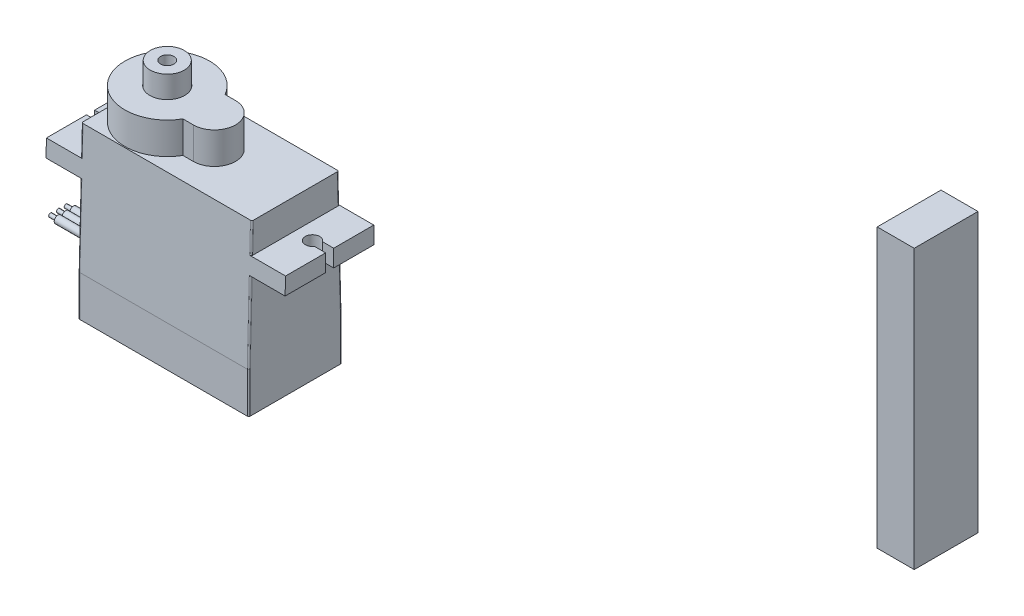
ISO-10303-21;
HEADER;
FILE_DESCRIPTION(('STEP AP214'),'2;1');
FILE_NAME('part.step','',(''),(''),'','','');
FILE_SCHEMA(('AUTOMOTIVE_DESIGN { 1 0 10303 214 1 1 1 1 }'));
ENDSEC;
DATA;
#1=APPLICATION_CONTEXT('core data for automotive mechanical design processes');
#2=APPLICATION_PROTOCOL_DEFINITION('international standard','automotive_design',2000,#1);
#3=PRODUCT_CONTEXT('',#1,'mechanical');
#4=PRODUCT('Part','Part','',(#3));
#5=PRODUCT_RELATED_PRODUCT_CATEGORY('part','',(#4));
#6=PRODUCT_DEFINITION_FORMATION('','',#4);
#7=PRODUCT_DEFINITION_CONTEXT('part definition',#1,'design');
#8=PRODUCT_DEFINITION('design','',#6,#7);
#9=PRODUCT_DEFINITION_SHAPE('','',#8);
#10=(LENGTH_UNIT() NAMED_UNIT(*) SI_UNIT(.MILLI.,.METRE.));
#11=(NAMED_UNIT(*) PLANE_ANGLE_UNIT() SI_UNIT($,.RADIAN.));
#12=(NAMED_UNIT(*) SI_UNIT($,.STERADIAN.) SOLID_ANGLE_UNIT());
#13=UNCERTAINTY_MEASURE_WITH_UNIT(LENGTH_MEASURE(1.E-05),#10,'distance_accuracy_value','');
#14=(GEOMETRIC_REPRESENTATION_CONTEXT(3) GLOBAL_UNCERTAINTY_ASSIGNED_CONTEXT((#13)) GLOBAL_UNIT_ASSIGNED_CONTEXT((#10,
#11,#12)) REPRESENTATION_CONTEXT('',''));
#15=CARTESIAN_POINT('',(0.,0.,0.));
#16=DIRECTION('',(0.,0.,1.));
#17=DIRECTION('',(1.,0.,0.));
#18=AXIS2_PLACEMENT_3D('',#15,#16,#17);
#19=CARTESIAN_POINT('',(5.,0.,0.));
#20=DIRECTION('',(0.,0.,-1.));
#21=DIRECTION('',(-1.,0.,0.));
#22=AXIS2_PLACEMENT_3D('',#19,#20,#21);
#23=PLANE('',#22);
#24=DIRECTION('',(0.,-1.,0.));
#25=VECTOR('',#24,1.);
#26=CARTESIAN_POINT('',(0.,0.,0.));
#27=LINE('',#26,#25);
#28=CARTESIAN_POINT('',(0.,37.6064753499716,0.));
#29=VERTEX_POINT('',#28);
#30=CARTESIAN_POINT('',(0.,0.,0.));
#31=VERTEX_POINT('',#30);
#32=EDGE_CURVE('E113',#29,#31,#27,.T.);
#33=ORIENTED_EDGE('',*,*,#32,.T.);
#34=DIRECTION('',(-1.,0.,0.));
#35=VECTOR('',#34,1.);
#36=CARTESIAN_POINT('',(5.,0.,0.));
#37=LINE('',#36,#35);
#38=CARTESIAN_POINT('',(5.,0.,0.));
#39=VERTEX_POINT('',#38);
#40=EDGE_CURVE('E12',#39,#31,#37,.T.);
#41=ORIENTED_EDGE('',*,*,#40,.F.);
#42=DIRECTION('',(0.,-1.,0.));
#43=VECTOR('',#42,1.);
#44=CARTESIAN_POINT('',(5.,0.,0.));
#45=LINE('',#44,#43);
#46=CARTESIAN_POINT('',(5.,37.6064753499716,0.));
#47=VERTEX_POINT('',#46);
#48=EDGE_CURVE('E101',#47,#39,#45,.T.);
#49=ORIENTED_EDGE('',*,*,#48,.F.);
#50=DIRECTION('',(-1.,0.,0.));
#51=VECTOR('',#50,1.);
#52=CARTESIAN_POINT('',(5.,37.6064753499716,0.));
#53=LINE('',#52,#51);
#54=EDGE_CURVE('E109',#47,#29,#53,.T.);
#55=ORIENTED_EDGE('',*,*,#54,.T.);
#56=EDGE_LOOP('',(#33,#41,#49,#55));
#57=FACE_BOUND('',#56,.T.);
#58=ADVANCED_FACE('F50',(#57),#23,.F.);
#59=CARTESIAN_POINT('',(5.,0.,0.));
#60=DIRECTION('',(0.,1.,0.));
#61=DIRECTION('',(0.,0.,1.));
#62=AXIS2_PLACEMENT_3D('',#59,#60,#61);
#63=PLANE('',#62);
#64=DIRECTION('',(0.,0.,-1.));
#65=VECTOR('',#64,1.);
#66=CARTESIAN_POINT('',(0.,0.,0.));
#67=LINE('',#66,#65);
#68=CARTESIAN_POINT('',(0.,0.,-8.61945224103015));
#69=VERTEX_POINT('',#68);
#70=EDGE_CURVE('E105',#31,#69,#67,.T.);
#71=ORIENTED_EDGE('',*,*,#70,.T.);
#72=DIRECTION('',(-1.,0.,0.));
#73=VECTOR('',#72,1.);
#74=CARTESIAN_POINT('',(5.,0.,-8.61945224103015));
#75=LINE('',#74,#73);
#76=CARTESIAN_POINT('',(5.,0.,-8.61945224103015));
#77=VERTEX_POINT('',#76);
#78=EDGE_CURVE('E58',#77,#69,#75,.T.);
#79=ORIENTED_EDGE('',*,*,#78,.F.);
#80=DIRECTION('',(0.,0.,-1.));
#81=VECTOR('',#80,1.);
#82=CARTESIAN_POINT('',(5.,0.,0.));
#83=LINE('',#82,#81);
#84=EDGE_CURVE('E96',#39,#77,#83,.T.);
#85=ORIENTED_EDGE('',*,*,#84,.F.);
#86=ORIENTED_EDGE('',*,*,#40,.T.);
#87=EDGE_LOOP('',(#71,#79,#85,#86));
#88=FACE_BOUND('',#87,.T.);
#89=ADVANCED_FACE('F104',(#88),#63,.F.);
#90=CARTESIAN_POINT('',(5.,0.,-8.61945224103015));
#91=DIRECTION('',(0.,0.,1.));
#92=DIRECTION('',(1.,0.,0.));
#93=AXIS2_PLACEMENT_3D('',#90,#91,#92);
#94=PLANE('',#93);
#95=DIRECTION('',(0.,1.,0.));
#96=VECTOR('',#95,1.);
#97=CARTESIAN_POINT('',(0.,0.,-8.61945224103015));
#98=LINE('',#97,#96);
#99=CARTESIAN_POINT('',(0.,37.6064753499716,-8.61945224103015));
#100=VERTEX_POINT('',#99);
#101=EDGE_CURVE('E83',#69,#100,#98,.T.);
#102=ORIENTED_EDGE('',*,*,#101,.T.);
#103=DIRECTION('',(-1.,0.,0.));
#104=VECTOR('',#103,1.);
#105=CARTESIAN_POINT('',(5.,37.6064753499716,-8.61945224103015));
#106=LINE('',#105,#104);
#107=CARTESIAN_POINT('',(5.,37.6064753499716,-8.61945224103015));
#108=VERTEX_POINT('',#107);
#109=EDGE_CURVE('E106',#108,#100,#106,.T.);
#110=ORIENTED_EDGE('',*,*,#109,.F.);
#111=DIRECTION('',(0.,1.,0.));
#112=VECTOR('',#111,1.);
#113=CARTESIAN_POINT('',(5.,0.,-8.61945224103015));
#114=LINE('',#113,#112);
#115=EDGE_CURVE('E99',#77,#108,#114,.T.);
#116=ORIENTED_EDGE('',*,*,#115,.F.);
#117=ORIENTED_EDGE('',*,*,#78,.T.);
#118=EDGE_LOOP('',(#102,#110,#116,#117));
#119=FACE_BOUND('',#118,.T.);
#120=ADVANCED_FACE('F107',(#119),#94,.F.);
#121=CARTESIAN_POINT('',(5.,37.6064753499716,0.));
#122=DIRECTION('',(0.,-1.,0.));
#123=DIRECTION('',(0.,0.,-1.));
#124=AXIS2_PLACEMENT_3D('',#121,#122,#123);
#125=PLANE('',#124);
#126=DIRECTION('',(0.,0.,1.));
#127=VECTOR('',#126,1.);
#128=CARTESIAN_POINT('',(0.,37.6064753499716,0.));
#129=LINE('',#128,#127);
#130=EDGE_CURVE('E89',#100,#29,#129,.T.);
#131=ORIENTED_EDGE('',*,*,#130,.T.);
#132=ORIENTED_EDGE('',*,*,#54,.F.);
#133=DIRECTION('',(0.,0.,1.));
#134=VECTOR('',#133,1.);
#135=CARTESIAN_POINT('',(5.,37.6064753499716,0.));
#136=LINE('',#135,#134);
#137=EDGE_CURVE('E66',#108,#47,#136,.T.);
#138=ORIENTED_EDGE('',*,*,#137,.F.);
#139=ORIENTED_EDGE('',*,*,#109,.T.);
#140=EDGE_LOOP('',(#131,#132,#138,#139));
#141=FACE_BOUND('',#140,.T.);
#142=ADVANCED_FACE('F120',(#141),#125,.F.);
#143=CARTESIAN_POINT('',(5.,0.,0.));
#144=DIRECTION('',(-1.,0.,0.));
#145=DIRECTION('',(0.,0.,1.));
#146=AXIS2_PLACEMENT_3D('',#143,#144,#145);
#147=PLANE('',#146);
#148=ORIENTED_EDGE('',*,*,#48,.T.);
#149=ORIENTED_EDGE('',*,*,#84,.T.);
#150=ORIENTED_EDGE('',*,*,#115,.T.);
#151=ORIENTED_EDGE('',*,*,#137,.T.);
#152=EDGE_LOOP('',(#148,#149,#150,#151));
#153=FACE_BOUND('',#152,.T.);
#154=ADVANCED_FACE('F97',(#153),#147,.F.);
#155=CARTESIAN_POINT('',(0.,0.,0.));
#156=DIRECTION('',(-1.,0.,0.));
#157=DIRECTION('',(0.,0.,1.));
#158=AXIS2_PLACEMENT_3D('',#155,#156,#157);
#159=PLANE('',#158);
#160=ORIENTED_EDGE('',*,*,#32,.F.);
#161=ORIENTED_EDGE('',*,*,#130,.F.);
#162=ORIENTED_EDGE('',*,*,#101,.F.);
#163=ORIENTED_EDGE('',*,*,#70,.F.);
#164=EDGE_LOOP('',(#160,#161,#162,#163));
#165=FACE_BOUND('',#164,.T.);
#166=ADVANCED_FACE('F123',(#165),#159,.T.);
#167=CLOSED_SHELL('',(#58,#89,#120,#142,#154,#166));
#168=MANIFOLD_SOLID_BREP('B2',#167);
#169=CARTESIAN_POINT('',(-85.6832283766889,8.16686648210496,22.9272998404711));
#170=DIRECTION('',(-1.,0.,0.));
#171=DIRECTION('',(0.,-1.,0.));
#172=AXIS2_PLACEMENT_3D('',#169,#170,#171);
#173=PLANE('',#172);
#174=CARTESIAN_POINT('',(-85.6832283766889,8.16686648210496,22.9272998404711));
#175=DIRECTION('',(-1.,0.,0.));
#176=DIRECTION('',(0.,-1.,0.));
#177=AXIS2_PLACEMENT_3D('',#174,#175,#176);
#178=CIRCLE('',#177,0.500000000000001);
#179=CARTESIAN_POINT('',(-85.6832283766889,7.66686648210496,22.9272998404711));
#180=VERTEX_POINT('',#179);
#181=EDGE_CURVE('E763',#180,#180,#178,.T.);
#182=ORIENTED_EDGE('',*,*,#181,.T.);
#183=EDGE_LOOP('',(#182));
#184=FACE_BOUND('',#183,.T.);
#185=CARTESIAN_POINT('',(-85.6832283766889,8.16686648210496,22.9272998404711));
#186=DIRECTION('',(-1.,0.,0.));
#187=DIRECTION('',(0.,-1.,0.));
#188=AXIS2_PLACEMENT_3D('',#185,#186,#187);
#189=CIRCLE('',#188,0.25);
#190=CARTESIAN_POINT('',(-85.6832283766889,7.91686648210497,22.9272998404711));
#191=VERTEX_POINT('',#190);
#192=EDGE_CURVE('E728',#191,#191,#189,.T.);
#193=ORIENTED_EDGE('',*,*,#192,.F.);
#194=EDGE_LOOP('',(#193));
#195=FACE_BOUND('',#194,.T.);
#196=ADVANCED_FACE('F181',(#184,#195),#173,.T.);
#197=CARTESIAN_POINT('',(-85.6832283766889,8.16686648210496,25.0272998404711));
#198=DIRECTION('',(-1.,0.,0.));
#199=DIRECTION('',(0.,-1.,0.));
#200=AXIS2_PLACEMENT_3D('',#197,#198,#199);
#201=PLANE('',#200);
#202=CARTESIAN_POINT('',(-85.6832283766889,8.16686648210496,25.0272998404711));
#203=DIRECTION('',(-1.,0.,0.));
#204=DIRECTION('',(0.,-1.,0.));
#205=AXIS2_PLACEMENT_3D('',#202,#203,#204);
#206=CIRCLE('',#205,0.5);
#207=CARTESIAN_POINT('',(-85.6832283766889,7.66686648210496,25.0272998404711));
#208=VERTEX_POINT('',#207);
#209=EDGE_CURVE('E768',#208,#208,#206,.T.);
#210=ORIENTED_EDGE('',*,*,#209,.T.);
#211=EDGE_LOOP('',(#210));
#212=FACE_BOUND('',#211,.T.);
#213=CARTESIAN_POINT('',(-85.6832283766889,8.16686648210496,25.0272998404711));
#214=DIRECTION('',(-1.,0.,0.));
#215=DIRECTION('',(0.,-1.,0.));
#216=AXIS2_PLACEMENT_3D('',#213,#214,#215);
#217=CIRCLE('',#216,0.25);
#218=CARTESIAN_POINT('',(-85.6832283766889,7.91686648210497,25.0272998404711));
#219=VERTEX_POINT('',#218);
#220=EDGE_CURVE('E751',#219,#219,#217,.T.);
#221=ORIENTED_EDGE('',*,*,#220,.F.);
#222=EDGE_LOOP('',(#221));
#223=FACE_BOUND('',#222,.T.);
#224=ADVANCED_FACE('F963',(#212,#223),#201,.T.);
#225=CARTESIAN_POINT('',(-85.6832283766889,8.16686648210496,23.9772998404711));
#226=DIRECTION('',(-1.,0.,0.));
#227=DIRECTION('',(0.,-1.,0.));
#228=AXIS2_PLACEMENT_3D('',#225,#226,#227);
#229=PLANE('',#228);
#230=CARTESIAN_POINT('',(-85.6832283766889,8.16686648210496,23.9772998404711));
#231=DIRECTION('',(-1.,0.,0.));
#232=DIRECTION('',(0.,-1.,0.));
#233=AXIS2_PLACEMENT_3D('',#230,#231,#232);
#234=CIRCLE('',#233,0.5);
#235=CARTESIAN_POINT('',(-85.6832283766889,7.66686648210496,23.9772998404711));
#236=VERTEX_POINT('',#235);
#237=EDGE_CURVE('E771',#236,#236,#234,.T.);
#238=ORIENTED_EDGE('',*,*,#237,.T.);
#239=EDGE_LOOP('',(#238));
#240=FACE_BOUND('',#239,.T.);
#241=CARTESIAN_POINT('',(-85.6832283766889,8.16686648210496,23.9772998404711));
#242=DIRECTION('',(-1.,0.,0.));
#243=DIRECTION('',(0.,-1.,0.));
#244=AXIS2_PLACEMENT_3D('',#241,#242,#243);
#245=CIRCLE('',#244,0.25);
#246=CARTESIAN_POINT('',(-85.6832283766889,7.91686648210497,23.9772998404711));
#247=VERTEX_POINT('',#246);
#248=EDGE_CURVE('E757',#247,#247,#245,.T.);
#249=ORIENTED_EDGE('',*,*,#248,.F.);
#250=EDGE_LOOP('',(#249));
#251=FACE_BOUND('',#250,.T.);
#252=ADVANCED_FACE('F969',(#240,#251),#229,.T.);
#253=CARTESIAN_POINT('',(-77.6832283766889,19.506866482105,30.2722998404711));
#254=DIRECTION('',(1.,0.,0.));
#255=DIRECTION('',(0.,0.,-1.));
#256=AXIS2_PLACEMENT_3D('',#253,#254,#255);
#257=PLANE('',#256);
#258=CARTESIAN_POINT('',(-77.6832283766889,8.16686648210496,25.0272998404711));
#259=DIRECTION('',(1.,0.,0.));
#260=DIRECTION('',(0.,0.,-1.));
#261=AXIS2_PLACEMENT_3D('',#258,#259,#260);
#262=CIRCLE('',#261,0.5);
#263=CARTESIAN_POINT('',(-77.6832283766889,8.16686648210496,24.5272998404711));
#264=VERTEX_POINT('',#263);
#265=EDGE_CURVE('E607',#264,#264,#262,.F.);
#266=ORIENTED_EDGE('',*,*,#265,.F.);
#267=EDGE_LOOP('',(#266));
#268=FACE_BOUND('',#267,.T.);
#269=DIRECTION('',(0.,0.,-1.));
#270=VECTOR('',#269,1.);
#271=CARTESIAN_POINT('',(-77.6832283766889,19.506866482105,30.2722998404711));
#272=LINE('',#271,#270);
#273=CARTESIAN_POINT('',(-77.6832283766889,19.506866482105,29.7984032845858));
#274=VERTEX_POINT('',#273);
#275=CARTESIAN_POINT('',(-77.6832283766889,19.506866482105,18.1561963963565));
#276=VERTEX_POINT('',#275);
#277=EDGE_CURVE('E580',#274,#276,#272,.T.);
#278=ORIENTED_EDGE('',*,*,#277,.T.);
#279=DIRECTION('',(0.,-0.999681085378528,-0.0252532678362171));
#280=VECTOR('',#279,1.);
#281=CARTESIAN_POINT('',(-77.6832283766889,19.8127401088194,18.1639231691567));
#282=LINE('',#281,#280);
#283=CARTESIAN_POINT('',(-77.6832283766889,8.66434075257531,17.8822998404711));
#284=VERTEX_POINT('',#283);
#285=EDGE_CURVE('E655',#276,#284,#282,.T.);
#286=ORIENTED_EDGE('',*,*,#285,.T.);
#287=DIRECTION('',(0.,-1.,0.));
#288=VECTOR('',#287,1.);
#289=CARTESIAN_POINT('',(-77.6832283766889,19.506866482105,17.8822998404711));
#290=LINE('',#289,#288);
#291=CARTESIAN_POINT('',(-77.6832283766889,3.16686648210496,17.8822998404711));
#292=VERTEX_POINT('',#291);
#293=EDGE_CURVE('E653',#284,#292,#290,.T.);
#294=ORIENTED_EDGE('',*,*,#293,.T.);
#295=DIRECTION('',(0.,0.,-1.));
#296=VECTOR('',#295,1.);
#297=CARTESIAN_POINT('',(-77.6832283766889,3.16686648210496,30.2722998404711));
#298=LINE('',#297,#296);
#299=CARTESIAN_POINT('',(-77.6832283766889,3.16686648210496,30.0722998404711));
#300=VERTEX_POINT('',#299);
#301=EDGE_CURVE('E577',#300,#292,#298,.T.);
#302=ORIENTED_EDGE('',*,*,#301,.F.);
#303=DIRECTION('',(0.,-1.,0.));
#304=VECTOR('',#303,1.);
#305=CARTESIAN_POINT('',(-77.6832283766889,8.66686648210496,30.0722998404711));
#306=LINE('',#305,#304);
#307=CARTESIAN_POINT('',(-77.6832283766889,8.66434075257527,30.0722998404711));
#308=VERTEX_POINT('',#307);
#309=EDGE_CURVE('E649',#300,#308,#306,.F.);
#310=ORIENTED_EDGE('',*,*,#309,.T.);
#311=DIRECTION('',(0.,-0.999681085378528,0.0252532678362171));
#312=VECTOR('',#311,1.);
#313=CARTESIAN_POINT('',(-77.6832283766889,19.5018158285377,29.7985308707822));
#314=LINE('',#313,#312);
#315=EDGE_CURVE('E651',#308,#274,#314,.F.);
#316=ORIENTED_EDGE('',*,*,#315,.T.);
#317=EDGE_LOOP('',(#278,#286,#294,#302,#310,#316));
#318=FACE_BOUND('',#317,.T.);
#319=CARTESIAN_POINT('',(-77.6832283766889,8.16686648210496,23.9772998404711));
#320=DIRECTION('',(1.,0.,0.));
#321=DIRECTION('',(0.,0.,-1.));
#322=AXIS2_PLACEMENT_3D('',#319,#320,#321);
#323=CIRCLE('',#322,0.5);
#324=CARTESIAN_POINT('',(-77.6832283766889,8.16686648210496,23.4772998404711));
#325=VERTEX_POINT('',#324);
#326=EDGE_CURVE('E604',#325,#325,#323,.F.);
#327=ORIENTED_EDGE('',*,*,#326,.F.);
#328=EDGE_LOOP('',(#327));
#329=FACE_BOUND('',#328,.T.);
#330=CARTESIAN_POINT('',(-77.6832283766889,8.16686648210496,22.9272998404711));
#331=DIRECTION('',(1.,0.,0.));
#332=DIRECTION('',(0.,0.,-1.));
#333=AXIS2_PLACEMENT_3D('',#330,#331,#332);
#334=CIRCLE('',#333,0.500000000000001);
#335=CARTESIAN_POINT('',(-77.6832283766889,8.16686648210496,22.4272998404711));
#336=VERTEX_POINT('',#335);
#337=EDGE_CURVE('E610',#336,#336,#334,.F.);
#338=ORIENTED_EDGE('',*,*,#337,.F.);
#339=EDGE_LOOP('',(#338));
#340=FACE_BOUND('',#339,.T.);
#341=ADVANCED_FACE('F858',(#268,#318,#329,#340),#257,.F.);
#342=CARTESIAN_POINT('',(-54.6532283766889,19.506866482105,30.2722998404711));
#343=DIRECTION('',(0.,1.,0.));
#344=DIRECTION('',(-1.,0.,0.));
#345=AXIS2_PLACEMENT_3D('',#342,#343,#344);
#346=PLANE('',#345);
#347=DIRECTION('',(1.,0.,0.));
#348=VECTOR('',#347,1.);
#349=CARTESIAN_POINT('',(-51.5247730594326,19.506866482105,24.5222998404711));
#350=LINE('',#349,#348);
#351=CARTESIAN_POINT('',(-51.5247730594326,19.506866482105,24.5222998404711));
#352=VERTEX_POINT('',#351);
#353=CARTESIAN_POINT('',(-50.0132283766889,19.506866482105,24.5222998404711));
#354=VERTEX_POINT('',#353);
#355=EDGE_CURVE('E429',#352,#354,#350,.T.);
#356=ORIENTED_EDGE('',*,*,#355,.T.);
#357=DIRECTION('',(0.,0.,-1.));
#358=VECTOR('',#357,1.);
#359=CARTESIAN_POINT('',(-50.0132283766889,19.506866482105,30.2722998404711));
#360=LINE('',#359,#358);
#361=CARTESIAN_POINT('',(-50.0132283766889,19.506866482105,29.9984670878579));
#362=VERTEX_POINT('',#361);
#363=EDGE_CURVE('E568',#362,#354,#360,.T.);
#364=ORIENTED_EDGE('',*,*,#363,.F.);
#365=DIRECTION('',(1.,0.,0.));
#366=VECTOR('',#365,1.);
#367=CARTESIAN_POINT('',(-54.6532283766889,19.506866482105,29.9984670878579));
#368=LINE('',#367,#366);
#369=CARTESIAN_POINT('',(-54.8532283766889,19.506866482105,29.9984670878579));
#370=VERTEX_POINT('',#369);
#371=EDGE_CURVE('E491',#370,#362,#368,.T.);
#372=ORIENTED_EDGE('',*,*,#371,.F.);
#373=CARTESIAN_POINT('',(-54.8532283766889,19.506866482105,29.7984032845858));
#374=DIRECTION('',(0.,1.,0.));
#375=DIRECTION('',(0.,0.,1.));
#376=AXIS2_PLACEMENT_3D('',#373,#374,#375);
#377=ELLIPSE('',#376,0.200063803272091,0.2);
#378=CARTESIAN_POINT('',(-54.6532283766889,19.506866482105,29.7984032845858));
#379=VERTEX_POINT('',#378);
#380=EDGE_CURVE('E715',#370,#379,#377,.T.);
#381=ORIENTED_EDGE('',*,*,#380,.T.);
#382=DIRECTION('',(0.,0.,-1.));
#383=VECTOR('',#382,1.);
#384=CARTESIAN_POINT('',(-54.6532283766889,19.506866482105,30.2722998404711));
#385=LINE('',#384,#383);
#386=CARTESIAN_POINT('',(-54.6532283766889,19.506866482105,18.1561963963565));
#387=VERTEX_POINT('',#386);
#388=EDGE_CURVE('E571',#379,#387,#385,.T.);
#389=ORIENTED_EDGE('',*,*,#388,.T.);
#390=CARTESIAN_POINT('',(-54.8532283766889,19.506866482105,18.1561963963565));
#391=DIRECTION('',(0.,1.,0.));
#392=DIRECTION('',(0.,0.,1.));
#393=AXIS2_PLACEMENT_3D('',#390,#391,#392);
#394=ELLIPSE('',#393,0.200063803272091,0.2);
#395=CARTESIAN_POINT('',(-54.8532283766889,19.506866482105,17.9561325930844));
#396=VERTEX_POINT('',#395);
#397=EDGE_CURVE('E717',#387,#396,#394,.T.);
#398=ORIENTED_EDGE('',*,*,#397,.T.);
#399=DIRECTION('',(1.,0.,0.));
#400=VECTOR('',#399,1.);
#401=CARTESIAN_POINT('',(-54.6532283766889,19.506866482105,17.9561325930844));
#402=LINE('',#401,#400);
#403=CARTESIAN_POINT('',(-50.0132283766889,19.506866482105,17.9561325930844));
#404=VERTEX_POINT('',#403);
#405=EDGE_CURVE('E508',#396,#404,#402,.T.);
#406=ORIENTED_EDGE('',*,*,#405,.T.);
#407=CARTESIAN_POINT('',(-50.0132283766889,19.506866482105,23.4322998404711));
#408=VERTEX_POINT('',#407);
#409=EDGE_CURVE('E444',#408,#404,#360,.T.);
#410=ORIENTED_EDGE('',*,*,#409,.F.);
#411=DIRECTION('',(1.,0.,0.));
#412=VECTOR('',#411,1.);
#413=CARTESIAN_POINT('',(-51.5247730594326,19.506866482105,23.4322998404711));
#414=LINE('',#413,#412);
#415=CARTESIAN_POINT('',(-51.5247730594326,19.506866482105,23.4322998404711));
#416=VERTEX_POINT('',#415);
#417=EDGE_CURVE('E422',#416,#408,#414,.T.);
#418=ORIENTED_EDGE('',*,*,#417,.F.);
#419=CARTESIAN_POINT('',(-52.3332283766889,19.506866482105,23.9772998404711));
#420=DIRECTION('',(0.,-1.,0.));
#421=DIRECTION('',(0.,0.,1.));
#422=AXIS2_PLACEMENT_3D('',#419,#420,#421);
#423=CIRCLE('',#422,0.975);
#424=EDGE_CURVE('E432',#352,#416,#423,.T.);
#425=ORIENTED_EDGE('',*,*,#424,.F.);
#426=EDGE_LOOP('',(#356,#364,#372,#381,#389,#398,#406,#410,#418,#425));
#427=FACE_BOUND('',#426,.T.);
#428=ADVANCED_FACE('F442',(#427),#346,.F.);
#429=CARTESIAN_POINT('',(-50.0132283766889,21.826866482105,30.2722998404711));
#430=DIRECTION('',(-1.,0.,0.));
#431=DIRECTION('',(0.,0.,1.));
#432=AXIS2_PLACEMENT_3D('',#429,#430,#431);
#433=PLANE('',#432);
#434=DIRECTION('',(0.,-1.,0.));
#435=VECTOR('',#434,1.);
#436=CARTESIAN_POINT('',(-50.0132283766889,30.166866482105,24.5222998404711));
#437=LINE('',#436,#435);
#438=CARTESIAN_POINT('',(-50.0132283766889,21.826866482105,24.5222998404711));
#439=VERTEX_POINT('',#438);
#440=EDGE_CURVE('E454',#439,#354,#437,.T.);
#441=ORIENTED_EDGE('',*,*,#440,.F.);
#442=DIRECTION('',(0.,0.,-1.));
#443=VECTOR('',#442,1.);
#444=CARTESIAN_POINT('',(-50.0132283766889,21.826866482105,30.2722998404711));
#445=LINE('',#444,#443);
#446=CARTESIAN_POINT('',(-50.0132283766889,21.826866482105,29.9398608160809));
#447=VERTEX_POINT('',#446);
#448=EDGE_CURVE('E565',#447,#439,#445,.T.);
#449=ORIENTED_EDGE('',*,*,#448,.F.);
#450=DIRECTION('',(0.,0.999681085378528,-0.0252532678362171));
#451=VECTOR('',#450,1.);
#452=CARTESIAN_POINT('',(-50.0132283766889,25.886866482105,29.8372998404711));
#453=LINE('',#452,#451);
#454=EDGE_CURVE('E482',#362,#447,#453,.T.);
#455=ORIENTED_EDGE('',*,*,#454,.F.);
#456=ORIENTED_EDGE('',*,*,#363,.T.);
#457=EDGE_LOOP('',(#441,#449,#455,#456));
#458=FACE_BOUND('',#457,.T.);
#459=ADVANCED_FACE('F947',(#458),#433,.F.);
#460=CARTESIAN_POINT('',(-54.6532283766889,21.826866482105,30.2722998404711));
#461=DIRECTION('',(0.,-1.,0.));
#462=DIRECTION('',(0.,0.,-1.));
#463=AXIS2_PLACEMENT_3D('',#460,#461,#462);
#464=PLANE('',#463);
#465=DIRECTION('',(1.,0.,0.));
#466=VECTOR('',#465,1.);
#467=CARTESIAN_POINT('',(-54.6532283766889,21.826866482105,24.5222998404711));
#468=LINE('',#467,#466);
#469=CARTESIAN_POINT('',(-51.5247730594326,21.826866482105,24.5222998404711));
#470=VERTEX_POINT('',#469);
#471=EDGE_CURVE('E602',#470,#439,#468,.T.);
#472=ORIENTED_EDGE('',*,*,#471,.F.);
#473=CARTESIAN_POINT('',(-52.3332283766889,21.826866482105,23.9772998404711));
#474=DIRECTION('',(0.,-1.,0.));
#475=DIRECTION('',(0.,0.,-1.));
#476=AXIS2_PLACEMENT_3D('',#473,#474,#475);
#477=CIRCLE('',#476,0.975);
#478=CARTESIAN_POINT('',(-51.5247730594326,21.826866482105,23.4322998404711));
#479=VERTEX_POINT('',#478);
#480=EDGE_CURVE('E600',#470,#479,#477,.T.);
#481=ORIENTED_EDGE('',*,*,#480,.T.);
#482=DIRECTION('',(1.,0.,0.));
#483=VECTOR('',#482,1.);
#484=CARTESIAN_POINT('',(-54.6532283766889,21.826866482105,23.4322998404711));
#485=LINE('',#484,#483);
#486=CARTESIAN_POINT('',(-50.0132283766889,21.826866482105,23.4322998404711));
#487=VERTEX_POINT('',#486);
#488=EDGE_CURVE('E425',#479,#487,#485,.T.);
#489=ORIENTED_EDGE('',*,*,#488,.T.);
#490=CARTESIAN_POINT('',(-50.0132283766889,21.826866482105,18.0147388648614));
#491=VERTEX_POINT('',#490);
#492=EDGE_CURVE('E564',#487,#491,#445,.T.);
#493=ORIENTED_EDGE('',*,*,#492,.T.);
#494=DIRECTION('',(-1.,0.,0.));
#495=VECTOR('',#494,1.);
#496=CARTESIAN_POINT('',(-54.6532283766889,21.826866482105,18.0147388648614));
#497=LINE('',#496,#495);
#498=CARTESIAN_POINT('',(-54.8532283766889,21.826866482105,18.0147388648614));
#499=VERTEX_POINT('',#498);
#500=EDGE_CURVE('E506',#491,#499,#497,.T.);
#501=ORIENTED_EDGE('',*,*,#500,.T.);
#502=CARTESIAN_POINT('',(-54.8532283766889,21.826866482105,18.2148026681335));
#503=DIRECTION('',(0.,-1.,0.));
#504=DIRECTION('',(0.,0.,1.));
#505=AXIS2_PLACEMENT_3D('',#502,#503,#504);
#506=ELLIPSE('',#505,0.200063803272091,0.2);
#507=CARTESIAN_POINT('',(-54.6532283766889,21.826866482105,18.2148026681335));
#508=VERTEX_POINT('',#507);
#509=EDGE_CURVE('E720',#499,#508,#506,.T.);
#510=ORIENTED_EDGE('',*,*,#509,.T.);
#511=DIRECTION('',(0.,0.,-1.));
#512=VECTOR('',#511,1.);
#513=CARTESIAN_POINT('',(-54.6532283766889,21.826866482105,30.2722998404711));
#514=LINE('',#513,#512);
#515=CARTESIAN_POINT('',(-54.6532283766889,21.826866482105,29.7397970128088));
#516=VERTEX_POINT('',#515);
#517=EDGE_CURVE('E561',#516,#508,#514,.T.);
#518=ORIENTED_EDGE('',*,*,#517,.F.);
#519=CARTESIAN_POINT('',(-54.8532283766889,21.826866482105,29.7397970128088));
#520=DIRECTION('',(0.,-1.,0.));
#521=DIRECTION('',(0.,0.,1.));
#522=AXIS2_PLACEMENT_3D('',#519,#520,#521);
#523=ELLIPSE('',#522,0.200063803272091,0.2);
#524=CARTESIAN_POINT('',(-54.8532283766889,21.826866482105,29.9398608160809));
#525=VERTEX_POINT('',#524);
#526=EDGE_CURVE('E722',#516,#525,#523,.T.);
#527=ORIENTED_EDGE('',*,*,#526,.T.);
#528=DIRECTION('',(-1.,0.,0.));
#529=VECTOR('',#528,1.);
#530=CARTESIAN_POINT('',(-54.6532283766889,21.826866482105,29.9398608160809));
#531=LINE('',#530,#529);
#532=EDGE_CURVE('E489',#447,#525,#531,.T.);
#533=ORIENTED_EDGE('',*,*,#532,.F.);
#534=ORIENTED_EDGE('',*,*,#448,.T.);
#535=EDGE_LOOP('',(#472,#481,#489,#493,#501,#510,#518,#527,#533,#534));
#536=FACE_BOUND('',#535,.T.);
#537=ADVANCED_FACE('F931',(#536),#464,.F.);
#538=CARTESIAN_POINT('',(-82.3232283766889,21.826866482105,30.2722998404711));
#539=DIRECTION('',(0.,-1.,0.));
#540=DIRECTION('',(1.,0.,0.));
#541=AXIS2_PLACEMENT_3D('',#538,#539,#540);
#542=PLANE('',#541);
#543=DIRECTION('',(-1.,0.,0.));
#544=VECTOR('',#543,1.);
#545=CARTESIAN_POINT('',(-82.3232283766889,21.826866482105,23.4322998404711));
#546=LINE('',#545,#544);
#547=CARTESIAN_POINT('',(-80.8116836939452,21.826866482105,23.4322998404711));
#548=VERTEX_POINT('',#547);
#549=CARTESIAN_POINT('',(-82.3232283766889,21.826866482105,23.4322998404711));
#550=VERTEX_POINT('',#549);
#551=EDGE_CURVE('E477',#548,#550,#546,.T.);
#552=ORIENTED_EDGE('',*,*,#551,.F.);
#553=CARTESIAN_POINT('',(-80.0032283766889,21.826866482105,23.9772998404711));
#554=DIRECTION('',(0.,-1.,0.));
#555=DIRECTION('',(1.,0.,0.));
#556=AXIS2_PLACEMENT_3D('',#553,#554,#555);
#557=CIRCLE('',#556,0.975);
#558=CARTESIAN_POINT('',(-80.8116836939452,21.826866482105,24.5222998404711));
#559=VERTEX_POINT('',#558);
#560=EDGE_CURVE('E479',#559,#548,#557,.F.);
#561=ORIENTED_EDGE('',*,*,#560,.F.);
#562=DIRECTION('',(-1.,0.,0.));
#563=VECTOR('',#562,1.);
#564=CARTESIAN_POINT('',(-82.3232283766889,21.826866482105,24.5222998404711));
#565=LINE('',#564,#563);
#566=CARTESIAN_POINT('',(-82.3232283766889,21.826866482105,24.5222998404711));
#567=VERTEX_POINT('',#566);
#568=EDGE_CURVE('E466',#559,#567,#565,.T.);
#569=ORIENTED_EDGE('',*,*,#568,.T.);
#570=DIRECTION('',(0.,0.,-1.));
#571=VECTOR('',#570,1.);
#572=CARTESIAN_POINT('',(-82.3232283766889,21.826866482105,30.2722998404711));
#573=LINE('',#572,#571);
#574=CARTESIAN_POINT('',(-82.3232283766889,21.826866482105,29.9398608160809));
#575=VERTEX_POINT('',#574);
#576=EDGE_CURVE('E588',#575,#567,#573,.T.);
#577=ORIENTED_EDGE('',*,*,#576,.F.);
#578=DIRECTION('',(-1.,0.,0.));
#579=VECTOR('',#578,1.);
#580=CARTESIAN_POINT('',(-82.3232283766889,21.826866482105,29.9398608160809));
#581=LINE('',#580,#579);
#582=CARTESIAN_POINT('',(-77.4832283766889,21.826866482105,29.9398608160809));
#583=VERTEX_POINT('',#582);
#584=EDGE_CURVE('E495',#583,#575,#581,.T.);
#585=ORIENTED_EDGE('',*,*,#584,.F.);
#586=CARTESIAN_POINT('',(-77.4832283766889,21.826866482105,29.7397970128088));
#587=DIRECTION('',(0.,-1.,0.));
#588=DIRECTION('',(0.,0.,-1.));
#589=AXIS2_PLACEMENT_3D('',#586,#587,#588);
#590=ELLIPSE('',#589,0.200063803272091,0.2);
#591=CARTESIAN_POINT('',(-77.6832283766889,21.826866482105,29.7397970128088));
#592=VERTEX_POINT('',#591);
#593=EDGE_CURVE('E48',#583,#592,#590,.T.);
#594=ORIENTED_EDGE('',*,*,#593,.T.);
#595=DIRECTION('',(0.,0.,-1.));
#596=VECTOR('',#595,1.);
#597=CARTESIAN_POINT('',(-77.6832283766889,21.826866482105,30.2722998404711));
#598=LINE('',#597,#596);
#599=CARTESIAN_POINT('',(-77.6832283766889,21.826866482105,18.2148026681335));
#600=VERTEX_POINT('',#599);
#601=EDGE_CURVE('E591',#592,#600,#598,.T.);
#602=ORIENTED_EDGE('',*,*,#601,.T.);
#603=CARTESIAN_POINT('',(-77.4832283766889,21.826866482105,18.2148026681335));
#604=DIRECTION('',(0.,-1.,0.));
#605=DIRECTION('',(0.,0.,-1.));
#606=AXIS2_PLACEMENT_3D('',#603,#604,#605);
#607=ELLIPSE('',#606,0.200063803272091,0.2);
#608=CARTESIAN_POINT('',(-77.4832283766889,21.826866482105,18.0147388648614));
#609=VERTEX_POINT('',#608);
#610=EDGE_CURVE('E190',#600,#609,#607,.T.);
#611=ORIENTED_EDGE('',*,*,#610,.T.);
#612=DIRECTION('',(-1.,0.,0.));
#613=VECTOR('',#612,1.);
#614=CARTESIAN_POINT('',(-82.3232283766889,21.826866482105,18.0147388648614));
#615=LINE('',#614,#613);
#616=CARTESIAN_POINT('',(-82.3232283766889,21.826866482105,18.0147388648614));
#617=VERTEX_POINT('',#616);
#618=EDGE_CURVE('E512',#609,#617,#615,.T.);
#619=ORIENTED_EDGE('',*,*,#618,.T.);
#620=EDGE_CURVE('E587',#550,#617,#573,.T.);
#621=ORIENTED_EDGE('',*,*,#620,.F.);
#622=EDGE_LOOP('',(#552,#561,#569,#577,#585,#594,#602,#611,#619,#621));
#623=FACE_BOUND('',#622,.T.);
#624=ADVANCED_FACE('F883',(#623),#542,.F.);
#625=CARTESIAN_POINT('',(-82.3232283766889,21.826866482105,30.2722998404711));
#626=DIRECTION('',(1.,0.,0.));
#627=DIRECTION('',(0.,0.,-1.));
#628=AXIS2_PLACEMENT_3D('',#625,#626,#627);
#629=PLANE('',#628);
#630=DIRECTION('',(0.,-1.,0.));
#631=VECTOR('',#630,1.);
#632=CARTESIAN_POINT('',(-82.3232283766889,30.166866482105,23.4322998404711));
#633=LINE('',#632,#631);
#634=CARTESIAN_POINT('',(-82.3232283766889,19.506866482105,23.4322998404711));
#635=VERTEX_POINT('',#634);
#636=EDGE_CURVE('E461',#550,#635,#633,.T.);
#637=ORIENTED_EDGE('',*,*,#636,.F.);
#638=ORIENTED_EDGE('',*,*,#620,.T.);
#639=DIRECTION('',(0.,0.999681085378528,0.0252532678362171));
#640=VECTOR('',#639,1.);
#641=CARTESIAN_POINT('',(-82.3232283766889,25.886866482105,18.1172998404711));
#642=LINE('',#641,#640);
#643=CARTESIAN_POINT('',(-82.3232283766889,19.506866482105,17.9561325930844));
#644=VERTEX_POINT('',#643);
#645=EDGE_CURVE('E497',#644,#617,#642,.T.);
#646=ORIENTED_EDGE('',*,*,#645,.F.);
#647=DIRECTION('',(0.,0.,-1.));
#648=VECTOR('',#647,1.);
#649=CARTESIAN_POINT('',(-82.3232283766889,19.506866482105,30.2722998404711));
#650=LINE('',#649,#648);
#651=EDGE_CURVE('E583',#635,#644,#650,.T.);
#652=ORIENTED_EDGE('',*,*,#651,.F.);
#653=EDGE_LOOP('',(#637,#638,#646,#652));
#654=FACE_BOUND('',#653,.T.);
#655=ADVANCED_FACE('F880',(#654),#629,.F.);
#656=CARTESIAN_POINT('',(-82.3232283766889,19.506866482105,30.2722998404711));
#657=DIRECTION('',(0.,1.,0.));
#658=DIRECTION('',(-1.,0.,0.));
#659=AXIS2_PLACEMENT_3D('',#656,#657,#658);
#660=PLANE('',#659);
#661=DIRECTION('',(-1.,0.,0.));
#662=VECTOR('',#661,1.);
#663=CARTESIAN_POINT('',(-80.8116836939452,19.506866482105,23.4322998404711));
#664=LINE('',#663,#662);
#665=CARTESIAN_POINT('',(-80.8116836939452,19.506866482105,23.4322998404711));
#666=VERTEX_POINT('',#665);
#667=EDGE_CURVE('E468',#666,#635,#664,.T.);
#668=ORIENTED_EDGE('',*,*,#667,.T.);
#669=ORIENTED_EDGE('',*,*,#651,.T.);
#670=DIRECTION('',(1.,0.,0.));
#671=VECTOR('',#670,1.);
#672=CARTESIAN_POINT('',(-82.3232283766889,19.506866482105,17.9561325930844));
#673=LINE('',#672,#671);
#674=CARTESIAN_POINT('',(-77.4832283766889,19.506866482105,17.9561325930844));
#675=VERTEX_POINT('',#674);
#676=EDGE_CURVE('E510',#644,#675,#673,.T.);
#677=ORIENTED_EDGE('',*,*,#676,.T.);
#678=CARTESIAN_POINT('',(-77.4832283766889,19.506866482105,18.1561963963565));
#679=DIRECTION('',(0.,1.,0.));
#680=DIRECTION('',(0.,0.,-1.));
#681=AXIS2_PLACEMENT_3D('',#678,#679,#680);
#682=ELLIPSE('',#681,0.200063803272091,0.2);
#683=EDGE_CURVE('E713',#675,#276,#682,.T.);
#684=ORIENTED_EDGE('',*,*,#683,.T.);
#685=ORIENTED_EDGE('',*,*,#277,.F.);
#686=CARTESIAN_POINT('',(-77.4832283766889,19.506866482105,29.7984032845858));
#687=DIRECTION('',(0.,1.,0.));
#688=DIRECTION('',(0.,0.,-1.));
#689=AXIS2_PLACEMENT_3D('',#686,#687,#688);
#690=ELLIPSE('',#689,0.200063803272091,0.2);
#691=CARTESIAN_POINT('',(-77.4832283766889,19.506866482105,29.9984670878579));
#692=VERTEX_POINT('',#691);
#693=EDGE_CURVE('E710',#274,#692,#690,.T.);
#694=ORIENTED_EDGE('',*,*,#693,.T.);
#695=DIRECTION('',(1.,0.,0.));
#696=VECTOR('',#695,1.);
#697=CARTESIAN_POINT('',(-82.3232283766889,19.506866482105,29.9984670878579));
#698=LINE('',#697,#696);
#699=CARTESIAN_POINT('',(-82.3232283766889,19.506866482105,29.9984670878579));
#700=VERTEX_POINT('',#699);
#701=EDGE_CURVE('E493',#700,#692,#698,.T.);
#702=ORIENTED_EDGE('',*,*,#701,.F.);
#703=CARTESIAN_POINT('',(-82.3232283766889,19.506866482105,24.5222998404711));
#704=VERTEX_POINT('',#703);
#705=EDGE_CURVE('E584',#700,#704,#650,.T.);
#706=ORIENTED_EDGE('',*,*,#705,.T.);
#707=DIRECTION('',(-1.,0.,0.));
#708=VECTOR('',#707,1.);
#709=CARTESIAN_POINT('',(-80.8116836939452,19.506866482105,24.5222998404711));
#710=LINE('',#709,#708);
#711=CARTESIAN_POINT('',(-80.8116836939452,19.506866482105,24.5222998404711));
#712=VERTEX_POINT('',#711);
#713=EDGE_CURVE('E439',#712,#704,#710,.T.);
#714=ORIENTED_EDGE('',*,*,#713,.F.);
#715=CARTESIAN_POINT('',(-80.0032283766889,19.506866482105,23.9772998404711));
#716=DIRECTION('',(0.,1.,0.));
#717=DIRECTION('',(0.,0.,1.));
#718=AXIS2_PLACEMENT_3D('',#715,#716,#717);
#719=CIRCLE('',#718,0.975);
#720=EDGE_CURVE('E457',#712,#666,#719,.T.);
#721=ORIENTED_EDGE('',*,*,#720,.T.);
#722=EDGE_LOOP('',(#668,#669,#677,#684,#685,#694,#702,#706,#714,#721));
#723=FACE_BOUND('',#722,.T.);
#724=ADVANCED_FACE('F875',(#723),#660,.F.);
#725=CARTESIAN_POINT('',(-77.6832283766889,25.886866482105,30.2722998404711));
#726=DIRECTION('',(0.,-1.,0.));
#727=DIRECTION('',(1.,0.,0.));
#728=AXIS2_PLACEMENT_3D('',#725,#726,#727);
#729=PLANE('',#728);
#730=DIRECTION('',(0.,0.,-1.));
#731=VECTOR('',#730,1.);
#732=CARTESIAN_POINT('',(-54.6532283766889,25.886866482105,30.2722998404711));
#733=LINE('',#732,#731);
#734=CARTESIAN_POINT('',(-54.6532283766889,25.886866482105,29.637236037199));
#735=VERTEX_POINT('',#734);
#736=CARTESIAN_POINT('',(-54.6532283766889,25.886866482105,18.3173636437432));
#737=VERTEX_POINT('',#736);
#738=EDGE_CURVE('E558',#735,#737,#733,.T.);
#739=ORIENTED_EDGE('',*,*,#738,.T.);
#740=CARTESIAN_POINT('',(-54.8532283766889,25.886866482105,18.3173636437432));
#741=DIRECTION('',(0.,-1.,0.));
#742=DIRECTION('',(0.,0.,1.));
#743=AXIS2_PLACEMENT_3D('',#740,#741,#742);
#744=ELLIPSE('',#743,0.200063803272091,0.2);
#745=CARTESIAN_POINT('',(-54.8532283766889,25.886866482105,18.1172998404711));
#746=VERTEX_POINT('',#745);
#747=EDGE_CURVE('E700',#737,#746,#744,.F.);
#748=ORIENTED_EDGE('',*,*,#747,.T.);
#749=DIRECTION('',(-1.,0.,0.));
#750=VECTOR('',#749,1.);
#751=CARTESIAN_POINT('',(-50.0132283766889,25.886866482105,18.1172998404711));
#752=LINE('',#751,#750);
#753=CARTESIAN_POINT('',(-77.4832283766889,25.886866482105,18.1172998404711));
#754=VERTEX_POINT('',#753);
#755=EDGE_CURVE('E501',#746,#754,#752,.T.);
#756=ORIENTED_EDGE('',*,*,#755,.T.);
#757=CARTESIAN_POINT('',(-77.4832283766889,25.886866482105,18.3173636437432));
#758=DIRECTION('',(0.,-1.,0.));
#759=DIRECTION('',(0.,0.,-1.));
#760=AXIS2_PLACEMENT_3D('',#757,#758,#759);
#761=ELLIPSE('',#760,0.200063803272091,0.2);
#762=CARTESIAN_POINT('',(-77.6832283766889,25.886866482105,18.3173636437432));
#763=VERTEX_POINT('',#762);
#764=EDGE_CURVE('E696',#754,#763,#761,.F.);
#765=ORIENTED_EDGE('',*,*,#764,.T.);
#766=DIRECTION('',(0.,0.,-1.));
#767=VECTOR('',#766,1.);
#768=CARTESIAN_POINT('',(-77.6832283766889,25.886866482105,30.2722998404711));
#769=LINE('',#768,#767);
#770=CARTESIAN_POINT('',(-77.6832283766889,25.886866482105,23.9772998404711));
#771=VERTEX_POINT('',#770);
#772=EDGE_CURVE('E553',#771,#763,#769,.T.);
#773=ORIENTED_EDGE('',*,*,#772,.F.);
#774=CARTESIAN_POINT('',(-71.9582283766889,25.886866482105,23.9772998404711));
#775=DIRECTION('',(0.,1.,0.));
#776=DIRECTION('',(0.,0.,1.));
#777=AXIS2_PLACEMENT_3D('',#774,#775,#776);
#778=CIRCLE('',#777,5.725);
#779=CARTESIAN_POINT('',(-66.993037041,25.886866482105,21.1272998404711));
#780=VERTEX_POINT('',#779);
#781=EDGE_CURVE('E515',#780,#771,#778,.T.);
#782=ORIENTED_EDGE('',*,*,#781,.F.);
#783=DIRECTION('',(-1.,0.,0.));
#784=VECTOR('',#783,1.);
#785=CARTESIAN_POINT('',(-65.5832283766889,25.886866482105,21.1272998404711));
#786=LINE('',#785,#784);
#787=CARTESIAN_POINT('',(-65.5832283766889,25.886866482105,21.1272998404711));
#788=VERTEX_POINT('',#787);
#789=EDGE_CURVE('E520',#788,#780,#786,.T.);
#790=ORIENTED_EDGE('',*,*,#789,.F.);
#791=CARTESIAN_POINT('',(-65.5832283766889,25.886866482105,23.9772998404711));
#792=DIRECTION('',(0.,1.,0.));
#793=DIRECTION('',(0.,0.,1.));
#794=AXIS2_PLACEMENT_3D('',#791,#792,#793);
#795=CIRCLE('',#794,2.85);
#796=CARTESIAN_POINT('',(-65.5832283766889,25.886866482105,26.8272998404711));
#797=VERTEX_POINT('',#796);
#798=EDGE_CURVE('E533',#797,#788,#795,.T.);
#799=ORIENTED_EDGE('',*,*,#798,.F.);
#800=DIRECTION('',(1.,0.,0.));
#801=VECTOR('',#800,1.);
#802=CARTESIAN_POINT('',(-66.993037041,25.886866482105,26.8272998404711));
#803=LINE('',#802,#801);
#804=CARTESIAN_POINT('',(-66.993037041,25.886866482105,26.8272998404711));
#805=VERTEX_POINT('',#804);
#806=EDGE_CURVE('E529',#805,#797,#803,.T.);
#807=ORIENTED_EDGE('',*,*,#806,.F.);
#808=EDGE_CURVE('E530',#771,#805,#778,.T.);
#809=ORIENTED_EDGE('',*,*,#808,.F.);
#810=CARTESIAN_POINT('',(-77.6832283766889,25.886866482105,29.637236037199));
#811=VERTEX_POINT('',#810);
#812=EDGE_CURVE('E556',#811,#771,#769,.T.);
#813=ORIENTED_EDGE('',*,*,#812,.F.);
#814=CARTESIAN_POINT('',(-77.4832283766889,25.886866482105,29.637236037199));
#815=DIRECTION('',(0.,-1.,0.));
#816=DIRECTION('',(0.,0.,-1.));
#817=AXIS2_PLACEMENT_3D('',#814,#815,#816);
#818=ELLIPSE('',#817,0.200063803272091,0.2);
#819=CARTESIAN_POINT('',(-77.4832283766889,25.886866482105,29.8372998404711));
#820=VERTEX_POINT('',#819);
#821=EDGE_CURVE('E694',#811,#820,#818,.F.);
#822=ORIENTED_EDGE('',*,*,#821,.T.);
#823=DIRECTION('',(-1.,0.,0.));
#824=VECTOR('',#823,1.);
#825=CARTESIAN_POINT('',(-50.0132283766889,25.886866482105,29.8372998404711));
#826=LINE('',#825,#824);
#827=CARTESIAN_POINT('',(-54.8532283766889,25.886866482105,29.8372998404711));
#828=VERTEX_POINT('',#827);
#829=EDGE_CURVE('E484',#828,#820,#826,.T.);
#830=ORIENTED_EDGE('',*,*,#829,.F.);
#831=CARTESIAN_POINT('',(-54.8532283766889,25.886866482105,29.637236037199));
#832=DIRECTION('',(0.,-1.,0.));
#833=DIRECTION('',(0.,0.,1.));
#834=AXIS2_PLACEMENT_3D('',#831,#832,#833);
#835=ELLIPSE('',#834,0.200063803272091,0.2);
#836=EDGE_CURVE('E698',#828,#735,#835,.F.);
#837=ORIENTED_EDGE('',*,*,#836,.T.);
#838=EDGE_LOOP('',(#739,#748,#756,#765,#773,#782,#790,#799,#807,#809,#813,#822,#830,#837));
#839=FACE_BOUND('',#838,.T.);
#840=ADVANCED_FACE('F889',(#839),#729,.F.);
#841=CARTESIAN_POINT('',(-77.6832283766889,25.886866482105,30.2722998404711));
#842=DIRECTION('',(1.,0.,0.));
#843=DIRECTION('',(0.,0.,-1.));
#844=AXIS2_PLACEMENT_3D('',#841,#842,#843);
#845=PLANE('',#844);
#846=ORIENTED_EDGE('',*,*,#772,.T.);
#847=DIRECTION('',(0.,-0.999681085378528,-0.0252532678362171));
#848=VECTOR('',#847,1.);
#849=CARTESIAN_POINT('',(-77.6832283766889,26.1886714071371,18.3249876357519));
#850=LINE('',#849,#848);
#851=EDGE_CURVE('E708',#763,#600,#850,.T.);
#852=ORIENTED_EDGE('',*,*,#851,.T.);
#853=ORIENTED_EDGE('',*,*,#601,.F.);
#854=DIRECTION('',(0.,-0.999681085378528,0.0252532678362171));
#855=VECTOR('',#854,1.);
#856=CARTESIAN_POINT('',(-77.6832283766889,25.8818158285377,29.6373636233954));
#857=LINE('',#856,#855);
#858=EDGE_CURVE('E706',#592,#811,#857,.F.);
#859=ORIENTED_EDGE('',*,*,#858,.T.);
#860=ORIENTED_EDGE('',*,*,#812,.T.);
#861=EDGE_LOOP('',(#846,#852,#853,#859,#860));
#862=FACE_BOUND('',#861,.T.);
#863=ADVANCED_FACE('F894',(#862),#845,.F.);
#864=ORIENTED_EDGE('',*,*,#576,.T.);
#865=DIRECTION('',(0.,-1.,0.));
#866=VECTOR('',#865,1.);
#867=CARTESIAN_POINT('',(-82.3232283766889,30.166866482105,24.5222998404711));
#868=LINE('',#867,#866);
#869=EDGE_CURVE('E471',#567,#704,#868,.T.);
#870=ORIENTED_EDGE('',*,*,#869,.T.);
#871=ORIENTED_EDGE('',*,*,#705,.F.);
#872=DIRECTION('',(0.,0.999681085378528,-0.0252532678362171));
#873=VECTOR('',#872,1.);
#874=CARTESIAN_POINT('',(-82.3232283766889,25.886866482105,29.8372998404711));
#875=LINE('',#874,#873);
#876=EDGE_CURVE('E481',#700,#575,#875,.T.);
#877=ORIENTED_EDGE('',*,*,#876,.T.);
#878=EDGE_LOOP('',(#864,#870,#871,#877));
#879=FACE_BOUND('',#878,.T.);
#880=ADVANCED_FACE('F1090',(#879),#629,.F.);
#881=CARTESIAN_POINT('',(-54.6532283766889,19.506866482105,30.2722998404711));
#882=DIRECTION('',(-1.,0.,0.));
#883=DIRECTION('',(0.,0.,1.));
#884=AXIS2_PLACEMENT_3D('',#881,#882,#883);
#885=PLANE('',#884);
#886=DIRECTION('',(0.,1.,0.));
#887=VECTOR('',#886,1.);
#888=CARTESIAN_POINT('',(-54.6532283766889,19.506866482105,17.8822998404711));
#889=LINE('',#888,#887);
#890=CARTESIAN_POINT('',(-54.6532283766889,3.16686648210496,17.8822998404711));
#891=VERTEX_POINT('',#890);
#892=CARTESIAN_POINT('',(-54.6532283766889,8.66434075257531,17.8822998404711));
#893=VERTEX_POINT('',#892);
#894=EDGE_CURVE('E672',#891,#893,#889,.T.);
#895=ORIENTED_EDGE('',*,*,#894,.T.);
#896=DIRECTION('',(0.,0.999681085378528,0.0252532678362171));
#897=VECTOR('',#896,1.);
#898=CARTESIAN_POINT('',(-54.6532283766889,19.8127401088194,18.1639231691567));
#899=LINE('',#898,#897);
#900=EDGE_CURVE('E674',#893,#387,#899,.T.);
#901=ORIENTED_EDGE('',*,*,#900,.T.);
#902=ORIENTED_EDGE('',*,*,#388,.F.);
#903=DIRECTION('',(0.,0.999681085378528,-0.0252532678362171));
#904=VECTOR('',#903,1.);
#905=CARTESIAN_POINT('',(-54.6532283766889,8.66181582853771,30.0723636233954));
#906=LINE('',#905,#904);
#907=CARTESIAN_POINT('',(-54.6532283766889,8.66434075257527,30.0722998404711));
#908=VERTEX_POINT('',#907);
#909=EDGE_CURVE('E670',#379,#908,#906,.F.);
#910=ORIENTED_EDGE('',*,*,#909,.T.);
#911=DIRECTION('',(0.,1.,0.));
#912=VECTOR('',#911,1.);
#913=CARTESIAN_POINT('',(-54.6532283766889,3.16686648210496,30.0722998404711));
#914=LINE('',#913,#912);
#915=CARTESIAN_POINT('',(-54.6532283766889,3.16686648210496,30.0722998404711));
#916=VERTEX_POINT('',#915);
#917=EDGE_CURVE('E668',#908,#916,#914,.F.);
#918=ORIENTED_EDGE('',*,*,#917,.T.);
#919=DIRECTION('',(0.,0.,-1.));
#920=VECTOR('',#919,1.);
#921=CARTESIAN_POINT('',(-54.6532283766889,3.16686648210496,30.2722998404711));
#922=LINE('',#921,#920);
#923=EDGE_CURVE('E574',#916,#891,#922,.T.);
#924=ORIENTED_EDGE('',*,*,#923,.T.);
#925=EDGE_LOOP('',(#895,#901,#902,#910,#918,#924));
#926=FACE_BOUND('',#925,.T.);
#927=ADVANCED_FACE('F830',(#926),#885,.F.);
#928=ORIENTED_EDGE('',*,*,#492,.F.);
#929=DIRECTION('',(0.,-1.,0.));
#930=VECTOR('',#929,1.);
#931=CARTESIAN_POINT('',(-50.0132283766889,30.166866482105,23.4322998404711));
#932=LINE('',#931,#930);
#933=EDGE_CURVE('E428',#487,#408,#932,.T.);
#934=ORIENTED_EDGE('',*,*,#933,.T.);
#935=ORIENTED_EDGE('',*,*,#409,.T.);
#936=DIRECTION('',(0.,0.999681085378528,0.0252532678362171));
#937=VECTOR('',#936,1.);
#938=CARTESIAN_POINT('',(-50.0132283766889,25.886866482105,18.1172998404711));
#939=LINE('',#938,#937);
#940=EDGE_CURVE('E498',#404,#491,#939,.T.);
#941=ORIENTED_EDGE('',*,*,#940,.T.);
#942=EDGE_LOOP('',(#928,#934,#935,#941));
#943=FACE_BOUND('',#942,.T.);
#944=ADVANCED_FACE('F940',(#943),#433,.F.);
#945=CARTESIAN_POINT('',(-54.6532283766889,25.886866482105,30.2722998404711));
#946=DIRECTION('',(-1.,0.,0.));
#947=DIRECTION('',(0.,0.,1.));
#948=AXIS2_PLACEMENT_3D('',#945,#946,#947);
#949=PLANE('',#948);
#950=ORIENTED_EDGE('',*,*,#517,.T.);
#951=DIRECTION('',(0.,0.999681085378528,0.0252532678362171));
#952=VECTOR('',#951,1.);
#953=CARTESIAN_POINT('',(-54.6532283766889,26.1886714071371,18.3249876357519));
#954=LINE('',#953,#952);
#955=EDGE_CURVE('E691',#508,#737,#954,.T.);
#956=ORIENTED_EDGE('',*,*,#955,.T.);
#957=ORIENTED_EDGE('',*,*,#738,.F.);
#958=DIRECTION('',(0.,0.999681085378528,-0.0252532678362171));
#959=VECTOR('',#958,1.);
#960=CARTESIAN_POINT('',(-54.6532283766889,21.8218158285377,29.7399245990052));
#961=LINE('',#960,#959);
#962=EDGE_CURVE('E689',#735,#516,#961,.F.);
#963=ORIENTED_EDGE('',*,*,#962,.T.);
#964=EDGE_LOOP('',(#950,#956,#957,#963));
#965=FACE_BOUND('',#964,.T.);
#966=ADVANCED_FACE('F923',(#965),#949,.F.);
#967=CARTESIAN_POINT('',(-70.5532283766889,19.506866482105,30.2722998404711));
#968=DIRECTION('',(0.,0.,1.));
#969=DIRECTION('',(1.,0.,0.));
#970=AXIS2_PLACEMENT_3D('',#967,#968,#969);
#971=PLANE('',#970);
#972=DIRECTION('',(1.,0.,0.));
#973=VECTOR('',#972,1.);
#974=CARTESIAN_POINT('',(-77.6832283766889,3.16686648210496,30.2722998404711));
#975=LINE('',#974,#973);
#976=CARTESIAN_POINT('',(-77.4832283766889,3.16686648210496,30.2722998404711));
#977=VERTEX_POINT('',#976);
#978=CARTESIAN_POINT('',(-54.8532283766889,3.16686648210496,30.2722998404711));
#979=VERTEX_POINT('',#978);
#980=EDGE_CURVE('E550',#977,#979,#975,.T.);
#981=ORIENTED_EDGE('',*,*,#980,.T.);
#982=DIRECTION('',(0.,1.,0.));
#983=VECTOR('',#982,1.);
#984=CARTESIAN_POINT('',(-54.8532283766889,8.66686648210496,30.2722998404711));
#985=LINE('',#984,#983);
#986=CARTESIAN_POINT('',(-54.8532283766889,8.66686648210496,30.2722998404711));
#987=VERTEX_POINT('',#986);
#988=EDGE_CURVE('E704',#979,#987,#985,.T.);
#989=ORIENTED_EDGE('',*,*,#988,.T.);
#990=DIRECTION('',(-1.,0.,0.));
#991=VECTOR('',#990,1.);
#992=CARTESIAN_POINT('',(-70.5532283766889,8.66686648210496,30.2722998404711));
#993=LINE('',#992,#991);
#994=CARTESIAN_POINT('',(-77.4832283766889,8.66686648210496,30.2722998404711));
#995=VERTEX_POINT('',#994);
#996=EDGE_CURVE('E596',#987,#995,#993,.T.);
#997=ORIENTED_EDGE('',*,*,#996,.T.);
#998=DIRECTION('',(0.,-1.,0.));
#999=VECTOR('',#998,1.);
#1000=CARTESIAN_POINT('',(-77.4832283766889,3.16686648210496,30.2722998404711));
#1001=LINE('',#1000,#999);
#1002=EDGE_CURVE('E702',#995,#977,#1001,.T.);
#1003=ORIENTED_EDGE('',*,*,#1002,.T.);
#1004=EDGE_LOOP('',(#981,#989,#997,#1003));
#1005=FACE_BOUND('',#1004,.T.);
#1006=ADVANCED_FACE('F814',(#1005),#971,.T.);
#1007=CARTESIAN_POINT('',(-77.6832283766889,3.16686648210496,30.2722998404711));
#1008=DIRECTION('',(0.,1.,0.));
#1009=DIRECTION('',(0.,0.,1.));
#1010=AXIS2_PLACEMENT_3D('',#1007,#1008,#1009);
#1011=PLANE('',#1010);
#1012=CARTESIAN_POINT('',(-56.2932283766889,3.16686648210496,28.3272998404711));
#1013=DIRECTION('',(0.,-1.,0.));
#1014=DIRECTION('',(0.,0.,-1.));
#1015=AXIS2_PLACEMENT_3D('',#1012,#1013,#1014);
#1016=CIRCLE('',#1015,0.999999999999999);
#1017=CARTESIAN_POINT('',(-56.2932283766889,3.16686648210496,27.3272998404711));
#1018=VERTEX_POINT('',#1017);
#1019=EDGE_CURVE('E777',#1018,#1018,#1016,.T.);
#1020=ORIENTED_EDGE('',*,*,#1019,.F.);
#1021=EDGE_LOOP('',(#1020));
#1022=FACE_BOUND('',#1021,.T.);
#1023=CARTESIAN_POINT('',(-56.2932283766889,3.16686648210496,19.6272998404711));
#1024=DIRECTION('',(0.,-1.,0.));
#1025=DIRECTION('',(0.,0.,-1.));
#1026=AXIS2_PLACEMENT_3D('',#1023,#1024,#1025);
#1027=CIRCLE('',#1026,0.999999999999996);
#1028=CARTESIAN_POINT('',(-56.2932283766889,3.16686648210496,18.6272998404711));
#1029=VERTEX_POINT('',#1028);
#1030=EDGE_CURVE('E786',#1029,#1029,#1027,.T.);
#1031=ORIENTED_EDGE('',*,*,#1030,.F.);
#1032=EDGE_LOOP('',(#1031));
#1033=FACE_BOUND('',#1032,.T.);
#1034=CARTESIAN_POINT('',(-76.0432283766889,3.16686648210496,19.6272998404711));
#1035=DIRECTION('',(0.,-1.,0.));
#1036=DIRECTION('',(0.,0.,-1.));
#1037=AXIS2_PLACEMENT_3D('',#1034,#1035,#1036);
#1038=CIRCLE('',#1037,1.);
#1039=CARTESIAN_POINT('',(-76.0432283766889,3.16686648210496,18.6272998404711));
#1040=VERTEX_POINT('',#1039);
#1041=EDGE_CURVE('E795',#1040,#1040,#1038,.T.);
#1042=ORIENTED_EDGE('',*,*,#1041,.F.);
#1043=EDGE_LOOP('',(#1042));
#1044=FACE_BOUND('',#1043,.T.);
#1045=CARTESIAN_POINT('',(-76.0432283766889,3.16686648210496,28.3272998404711));
#1046=DIRECTION('',(0.,-1.,0.));
#1047=DIRECTION('',(0.,0.,-1.));
#1048=AXIS2_PLACEMENT_3D('',#1045,#1046,#1047);
#1049=CIRCLE('',#1048,1.);
#1050=CARTESIAN_POINT('',(-76.0432283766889,3.16686648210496,27.3272998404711));
#1051=VERTEX_POINT('',#1050);
#1052=EDGE_CURVE('E449',#1051,#1051,#1049,.T.);
#1053=ORIENTED_EDGE('',*,*,#1052,.F.);
#1054=EDGE_LOOP('',(#1053));
#1055=FACE_BOUND('',#1054,.T.);
#1056=DIRECTION('',(1.,0.,0.));
#1057=VECTOR('',#1056,1.);
#1058=CARTESIAN_POINT('',(-77.6832283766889,3.16686648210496,17.6822998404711));
#1059=LINE('',#1058,#1057);
#1060=CARTESIAN_POINT('',(-77.4832283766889,3.16686648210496,17.6822998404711));
#1061=VERTEX_POINT('',#1060);
#1062=CARTESIAN_POINT('',(-54.8532283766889,3.16686648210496,17.6822998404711));
#1063=VERTEX_POINT('',#1062);
#1064=EDGE_CURVE('E549',#1061,#1063,#1059,.T.);
#1065=ORIENTED_EDGE('',*,*,#1064,.T.);
#1066=CARTESIAN_POINT('',(-54.8532283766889,3.16686648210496,17.8822998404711));
#1067=DIRECTION('',(0.,1.,0.));
#1068=DIRECTION('',(0.,0.,1.));
#1069=AXIS2_PLACEMENT_3D('',#1066,#1067,#1068);
#1070=CIRCLE('',#1069,0.2);
#1071=EDGE_CURVE('E687',#1063,#891,#1070,.F.);
#1072=ORIENTED_EDGE('',*,*,#1071,.T.);
#1073=ORIENTED_EDGE('',*,*,#923,.F.);
#1074=CARTESIAN_POINT('',(-54.8532283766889,3.16686648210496,30.0722998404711));
#1075=DIRECTION('',(0.,1.,0.));
#1076=DIRECTION('',(0.,0.,1.));
#1077=AXIS2_PLACEMENT_3D('',#1074,#1075,#1076);
#1078=CIRCLE('',#1077,0.2);
#1079=EDGE_CURVE('E685',#916,#979,#1078,.F.);
#1080=ORIENTED_EDGE('',*,*,#1079,.T.);
#1081=ORIENTED_EDGE('',*,*,#980,.F.);
#1082=CARTESIAN_POINT('',(-77.4832283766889,3.16686648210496,30.0722998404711));
#1083=DIRECTION('',(0.,1.,0.));
#1084=DIRECTION('',(0.,0.,1.));
#1085=AXIS2_PLACEMENT_3D('',#1082,#1083,#1084);
#1086=CIRCLE('',#1085,0.2);
#1087=EDGE_CURVE('E681',#977,#300,#1086,.F.);
#1088=ORIENTED_EDGE('',*,*,#1087,.T.);
#1089=ORIENTED_EDGE('',*,*,#301,.T.);
#1090=CARTESIAN_POINT('',(-77.4832283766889,3.16686648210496,17.8822998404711));
#1091=DIRECTION('',(0.,1.,0.));
#1092=DIRECTION('',(0.,0.,1.));
#1093=AXIS2_PLACEMENT_3D('',#1090,#1091,#1092);
#1094=CIRCLE('',#1093,0.2);
#1095=EDGE_CURVE('E683',#292,#1061,#1094,.F.);
#1096=ORIENTED_EDGE('',*,*,#1095,.T.);
#1097=EDGE_LOOP('',(#1065,#1072,#1073,#1080,#1081,#1088,#1089,#1096));
#1098=FACE_BOUND('',#1097,.T.);
#1099=ADVANCED_FACE('F810',(#1022,#1033,#1044,#1055,#1098),#1011,.F.);
#1100=CARTESIAN_POINT('',(-70.5532283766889,19.506866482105,17.6822998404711));
#1101=DIRECTION('',(0.,0.,1.));
#1102=DIRECTION('',(1.,0.,0.));
#1103=AXIS2_PLACEMENT_3D('',#1100,#1101,#1102);
#1104=PLANE('',#1103);
#1105=DIRECTION('',(1.,0.,0.));
#1106=VECTOR('',#1105,1.);
#1107=CARTESIAN_POINT('',(-70.5532283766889,8.66686648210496,17.6822998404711));
#1108=LINE('',#1107,#1106);
#1109=CARTESIAN_POINT('',(-77.4832283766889,8.66686648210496,17.6822998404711));
#1110=VERTEX_POINT('',#1109);
#1111=CARTESIAN_POINT('',(-54.8532283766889,8.66686648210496,17.6822998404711));
#1112=VERTEX_POINT('',#1111);
#1113=EDGE_CURVE('E593',#1110,#1112,#1108,.T.);
#1114=ORIENTED_EDGE('',*,*,#1113,.T.);
#1115=DIRECTION('',(0.,1.,0.));
#1116=VECTOR('',#1115,1.);
#1117=CARTESIAN_POINT('',(-54.8532283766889,19.506866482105,17.6822998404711));
#1118=LINE('',#1117,#1116);
#1119=EDGE_CURVE('E679',#1112,#1063,#1118,.F.);
#1120=ORIENTED_EDGE('',*,*,#1119,.T.);
#1121=ORIENTED_EDGE('',*,*,#1064,.F.);
#1122=DIRECTION('',(0.,-1.,0.));
#1123=VECTOR('',#1122,1.);
#1124=CARTESIAN_POINT('',(-77.4832283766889,19.506866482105,17.6822998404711));
#1125=LINE('',#1124,#1123);
#1126=EDGE_CURVE('E677',#1061,#1110,#1125,.F.);
#1127=ORIENTED_EDGE('',*,*,#1126,.T.);
#1128=EDGE_LOOP('',(#1114,#1120,#1121,#1127));
#1129=FACE_BOUND('',#1128,.T.);
#1130=ADVANCED_FACE('F813',(#1129),#1104,.F.);
#1131=CARTESIAN_POINT('',(-71.9582283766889,30.166866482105,23.9772998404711));
#1132=DIRECTION('',(0.,-1.,0.));
#1133=DIRECTION('',(0.,0.,-1.));
#1134=AXIS2_PLACEMENT_3D('',#1131,#1132,#1133);
#1135=CYLINDRICAL_SURFACE('',#1134,5.725);
#1136=ORIENTED_EDGE('',*,*,#781,.T.);
#1137=ORIENTED_EDGE('',*,*,#808,.T.);
#1138=DIRECTION('',(0.,-1.,0.));
#1139=VECTOR('',#1138,1.);
#1140=CARTESIAN_POINT('',(-66.993037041,30.166866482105,26.8272998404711));
#1141=LINE('',#1140,#1139);
#1142=CARTESIAN_POINT('',(-66.993037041,30.166866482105,26.8272998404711));
#1143=VERTEX_POINT('',#1142);
#1144=EDGE_CURVE('E546',#1143,#805,#1141,.T.);
#1145=ORIENTED_EDGE('',*,*,#1144,.F.);
#1146=CARTESIAN_POINT('',(-71.9582283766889,30.166866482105,23.9772998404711));
#1147=DIRECTION('',(0.,1.,0.));
#1148=DIRECTION('',(0.,0.,1.));
#1149=AXIS2_PLACEMENT_3D('',#1146,#1147,#1148);
#1150=CIRCLE('',#1149,5.725);
#1151=CARTESIAN_POINT('',(-66.993037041,30.166866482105,21.1272998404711));
#1152=VERTEX_POINT('',#1151);
#1153=EDGE_CURVE('E516',#1152,#1143,#1150,.T.);
#1154=ORIENTED_EDGE('',*,*,#1153,.F.);
#1155=DIRECTION('',(0.,-1.,0.));
#1156=VECTOR('',#1155,1.);
#1157=CARTESIAN_POINT('',(-66.993037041,30.166866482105,21.1272998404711));
#1158=LINE('',#1157,#1156);
#1159=EDGE_CURVE('E526',#1152,#780,#1158,.T.);
#1160=ORIENTED_EDGE('',*,*,#1159,.T.);
#1161=EDGE_LOOP('',(#1136,#1137,#1145,#1154,#1160));
#1162=FACE_BOUND('',#1161,.T.);
#1163=ADVANCED_FACE('F900',(#1162),#1135,.T.);
#1164=CARTESIAN_POINT('',(-66.993037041,30.166866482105,26.8272998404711));
#1165=DIRECTION('',(0.,0.,-1.));
#1166=DIRECTION('',(-1.,0.,0.));
#1167=AXIS2_PLACEMENT_3D('',#1164,#1165,#1166);
#1168=PLANE('',#1167);
#1169=ORIENTED_EDGE('',*,*,#806,.T.);
#1170=DIRECTION('',(0.,-1.,0.));
#1171=VECTOR('',#1170,1.);
#1172=CARTESIAN_POINT('',(-65.5832283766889,30.166866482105,26.8272998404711));
#1173=LINE('',#1172,#1171);
#1174=CARTESIAN_POINT('',(-65.5832283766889,30.166866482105,26.8272998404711));
#1175=VERTEX_POINT('',#1174);
#1176=EDGE_CURVE('E543',#1175,#797,#1173,.T.);
#1177=ORIENTED_EDGE('',*,*,#1176,.F.);
#1178=DIRECTION('',(1.,0.,0.));
#1179=VECTOR('',#1178,1.);
#1180=CARTESIAN_POINT('',(-66.993037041,30.166866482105,26.8272998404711));
#1181=LINE('',#1180,#1179);
#1182=EDGE_CURVE('E519',#1143,#1175,#1181,.T.);
#1183=ORIENTED_EDGE('',*,*,#1182,.F.);
#1184=ORIENTED_EDGE('',*,*,#1144,.T.);
#1185=EDGE_LOOP('',(#1169,#1177,#1183,#1184));
#1186=FACE_BOUND('',#1185,.T.);
#1187=ADVANCED_FACE('F913',(#1186),#1168,.F.);
#1188=CARTESIAN_POINT('',(-65.5832283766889,30.166866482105,23.9772998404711));
#1189=DIRECTION('',(0.,-1.,0.));
#1190=DIRECTION('',(0.,0.,-1.));
#1191=AXIS2_PLACEMENT_3D('',#1188,#1189,#1190);
#1192=CYLINDRICAL_SURFACE('',#1191,2.85);
#1193=ORIENTED_EDGE('',*,*,#798,.T.);
#1194=DIRECTION('',(0.,-1.,0.));
#1195=VECTOR('',#1194,1.);
#1196=CARTESIAN_POINT('',(-65.5832283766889,30.166866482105,21.1272998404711));
#1197=LINE('',#1196,#1195);
#1198=CARTESIAN_POINT('',(-65.5832283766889,30.166866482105,21.1272998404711));
#1199=VERTEX_POINT('',#1198);
#1200=EDGE_CURVE('E540',#1199,#788,#1197,.T.);
#1201=ORIENTED_EDGE('',*,*,#1200,.F.);
#1202=CARTESIAN_POINT('',(-65.5832283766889,30.166866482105,23.9772998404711));
#1203=DIRECTION('',(0.,1.,0.));
#1204=DIRECTION('',(0.,0.,1.));
#1205=AXIS2_PLACEMENT_3D('',#1202,#1203,#1204);
#1206=CIRCLE('',#1205,2.85);
#1207=EDGE_CURVE('E522',#1175,#1199,#1206,.T.);
#1208=ORIENTED_EDGE('',*,*,#1207,.F.);
#1209=ORIENTED_EDGE('',*,*,#1176,.T.);
#1210=EDGE_LOOP('',(#1193,#1201,#1208,#1209));
#1211=FACE_BOUND('',#1210,.T.);
#1212=ADVANCED_FACE('F909',(#1211),#1192,.T.);
#1213=CARTESIAN_POINT('',(-65.5832283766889,30.166866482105,21.1272998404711));
#1214=DIRECTION('',(0.,0.,1.));
#1215=DIRECTION('',(1.,0.,0.));
#1216=AXIS2_PLACEMENT_3D('',#1213,#1214,#1215);
#1217=PLANE('',#1216);
#1218=ORIENTED_EDGE('',*,*,#789,.T.);
#1219=ORIENTED_EDGE('',*,*,#1159,.F.);
#1220=DIRECTION('',(-1.,0.,0.));
#1221=VECTOR('',#1220,1.);
#1222=CARTESIAN_POINT('',(-65.5832283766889,30.166866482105,21.1272998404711));
#1223=LINE('',#1222,#1221);
#1224=EDGE_CURVE('E524',#1199,#1152,#1223,.T.);
#1225=ORIENTED_EDGE('',*,*,#1224,.F.);
#1226=ORIENTED_EDGE('',*,*,#1200,.T.);
#1227=EDGE_LOOP('',(#1218,#1219,#1225,#1226));
#1228=FACE_BOUND('',#1227,.T.);
#1229=ADVANCED_FACE('F906',(#1228),#1217,.F.);
#1230=CARTESIAN_POINT('',(-71.9582283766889,30.166866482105,23.9772998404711));
#1231=DIRECTION('',(0.,1.,0.));
#1232=DIRECTION('',(0.,0.,1.));
#1233=AXIS2_PLACEMENT_3D('',#1230,#1231,#1232);
#1234=PLANE('',#1233);
#1235=CARTESIAN_POINT('',(-71.9582283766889,30.166866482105,23.9772998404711));
#1236=DIRECTION('',(0.,1.,0.));
#1237=DIRECTION('',(0.,0.,1.));
#1238=AXIS2_PLACEMENT_3D('',#1235,#1236,#1237);
#1239=CIRCLE('',#1238,2.35);
#1240=CARTESIAN_POINT('',(-71.9582283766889,30.166866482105,26.3272998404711));
#1241=VERTEX_POINT('',#1240);
#1242=EDGE_CURVE('E185',#1241,#1241,#1239,.T.);
#1243=ORIENTED_EDGE('',*,*,#1242,.F.);
#1244=EDGE_LOOP('',(#1243));
#1245=FACE_BOUND('',#1244,.T.);
#1246=ORIENTED_EDGE('',*,*,#1153,.T.);
#1247=ORIENTED_EDGE('',*,*,#1182,.T.);
#1248=ORIENTED_EDGE('',*,*,#1207,.T.);
#1249=ORIENTED_EDGE('',*,*,#1224,.T.);
#1250=EDGE_LOOP('',(#1246,#1247,#1248,#1249));
#1251=FACE_BOUND('',#1250,.T.);
#1252=ADVANCED_FACE('F1063',(#1245,#1251),#1234,.T.);
#1253=CARTESIAN_POINT('',(-50.0132283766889,25.886866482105,18.1172998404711));
#1254=DIRECTION('',(0.,-0.0252532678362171,0.999681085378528));
#1255=DIRECTION('',(0.,-0.999681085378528,-0.0252532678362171));
#1256=AXIS2_PLACEMENT_3D('',#1253,#1254,#1255);
#1257=PLANE('',#1256);
#1258=ORIENTED_EDGE('',*,*,#1113,.F.);
#1259=DIRECTION('',(0.,-0.999681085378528,-0.0252532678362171));
#1260=VECTOR('',#1259,1.);
#1261=CARTESIAN_POINT('',(-77.4832283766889,25.886866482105,18.1172998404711));
#1262=LINE('',#1261,#1260);
#1263=EDGE_CURVE('E665',#1110,#675,#1262,.F.);
#1264=ORIENTED_EDGE('',*,*,#1263,.T.);
#1265=ORIENTED_EDGE('',*,*,#676,.F.);
#1266=ORIENTED_EDGE('',*,*,#645,.T.);
#1267=ORIENTED_EDGE('',*,*,#618,.F.);
#1268=DIRECTION('',(0.,-0.999681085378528,-0.0252532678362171));
#1269=VECTOR('',#1268,1.);
#1270=CARTESIAN_POINT('',(-77.4832283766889,25.886866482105,18.1172998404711));
#1271=LINE('',#1270,#1269);
#1272=EDGE_CURVE('E658',#609,#754,#1271,.F.);
#1273=ORIENTED_EDGE('',*,*,#1272,.T.);
#1274=ORIENTED_EDGE('',*,*,#755,.F.);
#1275=DIRECTION('',(0.,0.999681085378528,0.0252532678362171));
#1276=VECTOR('',#1275,1.);
#1277=CARTESIAN_POINT('',(-54.8532283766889,25.886866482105,18.1172998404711));
#1278=LINE('',#1277,#1276);
#1279=EDGE_CURVE('E660',#746,#499,#1278,.F.);
#1280=ORIENTED_EDGE('',*,*,#1279,.T.);
#1281=ORIENTED_EDGE('',*,*,#500,.F.);
#1282=ORIENTED_EDGE('',*,*,#940,.F.);
#1283=ORIENTED_EDGE('',*,*,#405,.F.);
#1284=DIRECTION('',(0.,0.999681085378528,0.0252532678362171));
#1285=VECTOR('',#1284,1.);
#1286=CARTESIAN_POINT('',(-54.8532283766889,25.886866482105,18.1172998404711));
#1287=LINE('',#1286,#1285);
#1288=EDGE_CURVE('E663',#396,#1112,#1287,.F.);
#1289=ORIENTED_EDGE('',*,*,#1288,.T.);
#1290=EDGE_LOOP('',(#1258,#1264,#1265,#1266,#1267,#1273,#1274,#1280,#1281,#1282,#1283,#1289));
#1291=FACE_BOUND('',#1290,.T.);
#1292=ADVANCED_FACE('F868',(#1291),#1257,.F.);
#1293=CARTESIAN_POINT('',(-50.0132283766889,25.886866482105,29.8372998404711));
#1294=DIRECTION('',(0.,0.0252532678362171,0.999681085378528));
#1295=DIRECTION('',(0.,-0.999681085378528,0.0252532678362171));
#1296=AXIS2_PLACEMENT_3D('',#1293,#1294,#1295);
#1297=PLANE('',#1296);
#1298=ORIENTED_EDGE('',*,*,#701,.T.);
#1299=DIRECTION('',(0.,-0.999681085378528,0.0252532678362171));
#1300=VECTOR('',#1299,1.);
#1301=CARTESIAN_POINT('',(-77.4832283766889,8.66686648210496,30.2722998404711));
#1302=LINE('',#1301,#1300);
#1303=EDGE_CURVE('E646',#692,#995,#1302,.T.);
#1304=ORIENTED_EDGE('',*,*,#1303,.T.);
#1305=ORIENTED_EDGE('',*,*,#996,.F.);
#1306=DIRECTION('',(0.,0.999681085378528,-0.0252532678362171));
#1307=VECTOR('',#1306,1.);
#1308=CARTESIAN_POINT('',(-54.8532283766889,19.506866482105,29.9984670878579));
#1309=LINE('',#1308,#1307);
#1310=EDGE_CURVE('E643',#987,#370,#1309,.T.);
#1311=ORIENTED_EDGE('',*,*,#1310,.T.);
#1312=ORIENTED_EDGE('',*,*,#371,.T.);
#1313=ORIENTED_EDGE('',*,*,#454,.T.);
#1314=ORIENTED_EDGE('',*,*,#532,.T.);
#1315=DIRECTION('',(0.,0.999681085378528,-0.0252532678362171));
#1316=VECTOR('',#1315,1.);
#1317=CARTESIAN_POINT('',(-54.8532283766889,25.886866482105,29.8372998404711));
#1318=LINE('',#1317,#1316);
#1319=EDGE_CURVE('E640',#525,#828,#1318,.T.);
#1320=ORIENTED_EDGE('',*,*,#1319,.T.);
#1321=ORIENTED_EDGE('',*,*,#829,.T.);
#1322=DIRECTION('',(0.,-0.999681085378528,0.0252532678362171));
#1323=VECTOR('',#1322,1.);
#1324=CARTESIAN_POINT('',(-77.4832283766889,21.826866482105,29.9398608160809));
#1325=LINE('',#1324,#1323);
#1326=EDGE_CURVE('E637',#820,#583,#1325,.T.);
#1327=ORIENTED_EDGE('',*,*,#1326,.T.);
#1328=ORIENTED_EDGE('',*,*,#584,.T.);
#1329=ORIENTED_EDGE('',*,*,#876,.F.);
#1330=EDGE_LOOP('',(#1298,#1304,#1305,#1311,#1312,#1313,#1314,#1320,#1321,#1327,#1328,#1329));
#1331=FACE_BOUND('',#1330,.T.);
#1332=ADVANCED_FACE('F843',(#1331),#1297,.T.);
#1333=CARTESIAN_POINT('',(-80.0032283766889,30.166866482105,23.9772998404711));
#1334=DIRECTION('',(0.,-1.,0.));
#1335=DIRECTION('',(0.,0.,-1.));
#1336=AXIS2_PLACEMENT_3D('',#1333,#1334,#1335);
#1337=CYLINDRICAL_SURFACE('',#1336,0.975);
#1338=ORIENTED_EDGE('',*,*,#560,.T.);
#1339=DIRECTION('',(0.,-1.,0.));
#1340=VECTOR('',#1339,1.);
#1341=CARTESIAN_POINT('',(-80.8116836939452,30.166866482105,23.4322998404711));
#1342=LINE('',#1341,#1340);
#1343=EDGE_CURVE('E464',#548,#666,#1342,.T.);
#1344=ORIENTED_EDGE('',*,*,#1343,.T.);
#1345=ORIENTED_EDGE('',*,*,#720,.F.);
#1346=DIRECTION('',(0.,-1.,0.));
#1347=VECTOR('',#1346,1.);
#1348=CARTESIAN_POINT('',(-80.8116836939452,30.166866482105,24.5222998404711));
#1349=LINE('',#1348,#1347);
#1350=EDGE_CURVE('E460',#559,#712,#1349,.T.);
#1351=ORIENTED_EDGE('',*,*,#1350,.F.);
#1352=EDGE_LOOP('',(#1338,#1344,#1345,#1351));
#1353=FACE_BOUND('',#1352,.T.);
#1354=ADVANCED_FACE('F1048',(#1353),#1337,.F.);
#1355=CARTESIAN_POINT('',(-80.8116836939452,30.166866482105,23.4322998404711));
#1356=DIRECTION('',(0.,0.,1.));
#1357=DIRECTION('',(1.,0.,0.));
#1358=AXIS2_PLACEMENT_3D('',#1355,#1356,#1357);
#1359=PLANE('',#1358);
#1360=ORIENTED_EDGE('',*,*,#551,.T.);
#1361=ORIENTED_EDGE('',*,*,#636,.T.);
#1362=ORIENTED_EDGE('',*,*,#667,.F.);
#1363=ORIENTED_EDGE('',*,*,#1343,.F.);
#1364=EDGE_LOOP('',(#1360,#1361,#1362,#1363));
#1365=FACE_BOUND('',#1364,.T.);
#1366=ADVANCED_FACE('F1051',(#1365),#1359,.T.);
#1367=CARTESIAN_POINT('',(-80.8116836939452,30.166866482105,24.5222998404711));
#1368=DIRECTION('',(0.,0.,1.));
#1369=DIRECTION('',(1.,0.,0.));
#1370=AXIS2_PLACEMENT_3D('',#1367,#1368,#1369);
#1371=PLANE('',#1370);
#1372=ORIENTED_EDGE('',*,*,#1350,.T.);
#1373=ORIENTED_EDGE('',*,*,#713,.T.);
#1374=ORIENTED_EDGE('',*,*,#869,.F.);
#1375=ORIENTED_EDGE('',*,*,#568,.F.);
#1376=EDGE_LOOP('',(#1372,#1373,#1374,#1375));
#1377=FACE_BOUND('',#1376,.T.);
#1378=ADVANCED_FACE('F1047',(#1377),#1371,.F.);
#1379=CARTESIAN_POINT('',(-52.3332283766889,30.166866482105,23.9772998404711));
#1380=DIRECTION('',(0.,-1.,0.));
#1381=DIRECTION('',(1.,0.,0.));
#1382=AXIS2_PLACEMENT_3D('',#1379,#1380,#1381);
#1383=CYLINDRICAL_SURFACE('',#1382,0.975);
#1384=DIRECTION('',(0.,-1.,0.));
#1385=VECTOR('',#1384,1.);
#1386=CARTESIAN_POINT('',(-51.5247730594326,30.166866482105,24.5222998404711));
#1387=LINE('',#1386,#1385);
#1388=EDGE_CURVE('E435',#470,#352,#1387,.T.);
#1389=ORIENTED_EDGE('',*,*,#1388,.T.);
#1390=ORIENTED_EDGE('',*,*,#424,.T.);
#1391=DIRECTION('',(0.,-1.,0.));
#1392=VECTOR('',#1391,1.);
#1393=CARTESIAN_POINT('',(-51.5247730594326,30.166866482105,23.4322998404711));
#1394=LINE('',#1393,#1392);
#1395=EDGE_CURVE('E418',#479,#416,#1394,.T.);
#1396=ORIENTED_EDGE('',*,*,#1395,.F.);
#1397=ORIENTED_EDGE('',*,*,#480,.F.);
#1398=EDGE_LOOP('',(#1389,#1390,#1396,#1397));
#1399=FACE_BOUND('',#1398,.T.);
#1400=ADVANCED_FACE('F433',(#1399),#1383,.F.);
#1401=CARTESIAN_POINT('',(-51.5247730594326,30.166866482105,24.5222998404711));
#1402=DIRECTION('',(0.,0.,-1.));
#1403=DIRECTION('',(-1.,0.,0.));
#1404=AXIS2_PLACEMENT_3D('',#1401,#1402,#1403);
#1405=PLANE('',#1404);
#1406=ORIENTED_EDGE('',*,*,#471,.T.);
#1407=ORIENTED_EDGE('',*,*,#440,.T.);
#1408=ORIENTED_EDGE('',*,*,#355,.F.);
#1409=ORIENTED_EDGE('',*,*,#1388,.F.);
#1410=EDGE_LOOP('',(#1406,#1407,#1408,#1409));
#1411=FACE_BOUND('',#1410,.T.);
#1412=ADVANCED_FACE('F942',(#1411),#1405,.T.);
#1413=CARTESIAN_POINT('',(-51.5247730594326,30.166866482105,23.4322998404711));
#1414=DIRECTION('',(0.,0.,-1.));
#1415=DIRECTION('',(-1.,0.,0.));
#1416=AXIS2_PLACEMENT_3D('',#1413,#1414,#1415);
#1417=PLANE('',#1416);
#1418=ORIENTED_EDGE('',*,*,#1395,.T.);
#1419=ORIENTED_EDGE('',*,*,#417,.T.);
#1420=ORIENTED_EDGE('',*,*,#933,.F.);
#1421=ORIENTED_EDGE('',*,*,#488,.F.);
#1422=EDGE_LOOP('',(#1418,#1419,#1420,#1421));
#1423=FACE_BOUND('',#1422,.T.);
#1424=ADVANCED_FACE('F420',(#1423),#1417,.F.);
#1425=CARTESIAN_POINT('',(-76.0432283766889,4.16686648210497,28.3272998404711));
#1426=DIRECTION('',(0.,-1.,0.));
#1427=DIRECTION('',(0.,0.,-1.));
#1428=AXIS2_PLACEMENT_3D('',#1425,#1426,#1427);
#1429=CYLINDRICAL_SURFACE('',#1428,1.);
#1430=CARTESIAN_POINT('',(-76.0432283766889,4.16686648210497,28.3272998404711));
#1431=DIRECTION('',(0.,-1.,0.));
#1432=DIRECTION('',(0.,0.,-1.));
#1433=AXIS2_PLACEMENT_3D('',#1430,#1431,#1432);
#1434=CIRCLE('',#1433,1.);
#1435=CARTESIAN_POINT('',(-76.0432283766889,4.16686648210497,27.3272998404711));
#1436=VERTEX_POINT('',#1435);
#1437=EDGE_CURVE('E445',#1436,#1436,#1434,.T.);
#1438=ORIENTED_EDGE('',*,*,#1437,.F.);
#1439=EDGE_LOOP('',(#1438));
#1440=FACE_BOUND('',#1439,.T.);
#1441=ORIENTED_EDGE('',*,*,#1052,.T.);
#1442=EDGE_LOOP('',(#1441));
#1443=FACE_BOUND('',#1442,.T.);
#1444=ADVANCED_FACE('F808',(#1440,#1443),#1429,.F.);
#1445=CARTESIAN_POINT('',(-76.0432283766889,4.16686648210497,28.3272998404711));
#1446=DIRECTION('',(0.,-1.,0.));
#1447=DIRECTION('',(0.,0.,-1.));
#1448=AXIS2_PLACEMENT_3D('',#1445,#1446,#1447);
#1449=PLANE('',#1448);
#1450=CARTESIAN_POINT('',(-76.0432283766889,4.16686648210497,28.3272998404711));
#1451=DIRECTION('',(0.,-1.,0.));
#1452=DIRECTION('',(0.,0.,-1.));
#1453=AXIS2_PLACEMENT_3D('',#1450,#1451,#1452);
#1454=CIRCLE('',#1453,0.975);
#1455=CARTESIAN_POINT('',(-76.0432283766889,4.16686648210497,27.3522998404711));
#1456=VERTEX_POINT('',#1455);
#1457=EDGE_CURVE('E799',#1456,#1456,#1454,.T.);
#1458=ORIENTED_EDGE('',*,*,#1457,.F.);
#1459=EDGE_LOOP('',(#1458));
#1460=FACE_BOUND('',#1459,.T.);
#1461=ORIENTED_EDGE('',*,*,#1437,.T.);
#1462=EDGE_LOOP('',(#1461));
#1463=FACE_BOUND('',#1462,.T.);
#1464=ADVANCED_FACE('F1033',(#1460,#1463),#1449,.T.);
#1465=CARTESIAN_POINT('',(-76.0432283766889,4.16686648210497,28.3272998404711));
#1466=DIRECTION('',(0.,-1.,0.));
#1467=DIRECTION('',(0.,0.,-1.));
#1468=AXIS2_PLACEMENT_3D('',#1465,#1466,#1467);
#1469=CYLINDRICAL_SURFACE('',#1468,0.975);
#1470=CARTESIAN_POINT('',(-76.0432283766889,3.46686648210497,28.3272998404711));
#1471=DIRECTION('',(0.,1.,0.));
#1472=DIRECTION('',(0.,0.,1.));
#1473=AXIS2_PLACEMENT_3D('',#1470,#1471,#1472);
#1474=CIRCLE('',#1473,0.975);
#1475=CARTESIAN_POINT('',(-76.0432283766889,3.46686648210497,29.3022998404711));
#1476=VERTEX_POINT('',#1475);
#1477=EDGE_CURVE('E634',#1476,#1476,#1474,.T.);
#1478=ORIENTED_EDGE('',*,*,#1477,.T.);
#1479=EDGE_LOOP('',(#1478));
#1480=FACE_BOUND('',#1479,.T.);
#1481=ORIENTED_EDGE('',*,*,#1457,.T.);
#1482=EDGE_LOOP('',(#1481));
#1483=FACE_BOUND('',#1482,.T.);
#1484=ADVANCED_FACE('F1030',(#1480,#1483),#1469,.T.);
#1485=CARTESIAN_POINT('',(-76.0432283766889,3.16686648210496,28.3272998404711));
#1486=DIRECTION('',(0.,1.,0.));
#1487=DIRECTION('',(0.,0.,1.));
#1488=AXIS2_PLACEMENT_3D('',#1485,#1486,#1487);
#1489=CIRCLE('',#1488,0.675);
#1490=CARTESIAN_POINT('',(-76.0432283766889,3.16686648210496,29.0022998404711));
#1491=VERTEX_POINT('',#1490);
#1492=EDGE_CURVE('E631',#1491,#1491,#1489,.F.);
#1493=ORIENTED_EDGE('',*,*,#1492,.T.);
#1494=EDGE_LOOP('',(#1493));
#1495=FACE_BOUND('',#1494,.T.);
#1496=ADVANCED_FACE('F818',(#1495),#1011,.F.);
#1497=CARTESIAN_POINT('',(-76.0432283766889,4.16686648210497,19.6272998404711));
#1498=DIRECTION('',(0.,-1.,0.));
#1499=DIRECTION('',(0.,0.,-1.));
#1500=AXIS2_PLACEMENT_3D('',#1497,#1498,#1499);
#1501=CYLINDRICAL_SURFACE('',#1500,1.);
#1502=CARTESIAN_POINT('',(-76.0432283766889,4.16686648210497,19.6272998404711));
#1503=DIRECTION('',(0.,-1.,0.));
#1504=DIRECTION('',(0.,0.,-1.));
#1505=AXIS2_PLACEMENT_3D('',#1502,#1503,#1504);
#1506=CIRCLE('',#1505,1.);
#1507=CARTESIAN_POINT('',(-76.0432283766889,4.16686648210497,18.6272998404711));
#1508=VERTEX_POINT('',#1507);
#1509=EDGE_CURVE('E796',#1508,#1508,#1506,.T.);
#1510=ORIENTED_EDGE('',*,*,#1509,.F.);
#1511=EDGE_LOOP('',(#1510));
#1512=FACE_BOUND('',#1511,.T.);
#1513=ORIENTED_EDGE('',*,*,#1041,.T.);
#1514=EDGE_LOOP('',(#1513));
#1515=FACE_BOUND('',#1514,.T.);
#1516=ADVANCED_FACE('F1025',(#1512,#1515),#1501,.F.);
#1517=CARTESIAN_POINT('',(-76.0432283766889,4.16686648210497,19.6272998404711));
#1518=DIRECTION('',(0.,-1.,0.));
#1519=DIRECTION('',(0.,0.,-1.));
#1520=AXIS2_PLACEMENT_3D('',#1517,#1518,#1519);
#1521=PLANE('',#1520);
#1522=CARTESIAN_POINT('',(-76.0432283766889,4.16686648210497,19.6272998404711));
#1523=DIRECTION('',(0.,-1.,0.));
#1524=DIRECTION('',(0.,0.,-1.));
#1525=AXIS2_PLACEMENT_3D('',#1522,#1523,#1524);
#1526=CIRCLE('',#1525,0.975);
#1527=CARTESIAN_POINT('',(-76.0432283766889,4.16686648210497,18.6522998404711));
#1528=VERTEX_POINT('',#1527);
#1529=EDGE_CURVE('E790',#1528,#1528,#1526,.T.);
#1530=ORIENTED_EDGE('',*,*,#1529,.F.);
#1531=EDGE_LOOP('',(#1530));
#1532=FACE_BOUND('',#1531,.T.);
#1533=ORIENTED_EDGE('',*,*,#1509,.T.);
#1534=EDGE_LOOP('',(#1533));
#1535=FACE_BOUND('',#1534,.T.);
#1536=ADVANCED_FACE('F1021',(#1532,#1535),#1521,.T.);
#1537=CARTESIAN_POINT('',(-76.0432283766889,4.16686648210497,19.6272998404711));
#1538=DIRECTION('',(0.,-1.,0.));
#1539=DIRECTION('',(0.,0.,-1.));
#1540=AXIS2_PLACEMENT_3D('',#1537,#1538,#1539);
#1541=CYLINDRICAL_SURFACE('',#1540,0.975);
#1542=CARTESIAN_POINT('',(-76.0432283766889,3.46686648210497,19.6272998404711));
#1543=DIRECTION('',(0.,1.,0.));
#1544=DIRECTION('',(0.,0.,1.));
#1545=AXIS2_PLACEMENT_3D('',#1542,#1543,#1544);
#1546=CIRCLE('',#1545,0.975);
#1547=CARTESIAN_POINT('',(-76.0432283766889,3.46686648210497,20.6022998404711));
#1548=VERTEX_POINT('',#1547);
#1549=EDGE_CURVE('E628',#1548,#1548,#1546,.T.);
#1550=ORIENTED_EDGE('',*,*,#1549,.T.);
#1551=EDGE_LOOP('',(#1550));
#1552=FACE_BOUND('',#1551,.T.);
#1553=ORIENTED_EDGE('',*,*,#1529,.T.);
#1554=EDGE_LOOP('',(#1553));
#1555=FACE_BOUND('',#1554,.T.);
#1556=ADVANCED_FACE('F1018',(#1552,#1555),#1541,.T.);
#1557=CARTESIAN_POINT('',(-76.0432283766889,3.16686648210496,19.6272998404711));
#1558=DIRECTION('',(0.,1.,0.));
#1559=DIRECTION('',(0.,0.,1.));
#1560=AXIS2_PLACEMENT_3D('',#1557,#1558,#1559);
#1561=CIRCLE('',#1560,0.675);
#1562=CARTESIAN_POINT('',(-76.0432283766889,3.16686648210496,20.3022998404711));
#1563=VERTEX_POINT('',#1562);
#1564=EDGE_CURVE('E625',#1563,#1563,#1561,.F.);
#1565=ORIENTED_EDGE('',*,*,#1564,.T.);
#1566=EDGE_LOOP('',(#1565));
#1567=FACE_BOUND('',#1566,.T.);
#1568=ADVANCED_FACE('F1016',(#1567),#1011,.F.);
#1569=CARTESIAN_POINT('',(-56.2932283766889,4.16686648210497,19.6272998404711));
#1570=DIRECTION('',(0.,-1.,0.));
#1571=DIRECTION('',(0.,0.,-1.));
#1572=AXIS2_PLACEMENT_3D('',#1569,#1570,#1571);
#1573=CYLINDRICAL_SURFACE('',#1572,0.999999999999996);
#1574=CARTESIAN_POINT('',(-56.2932283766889,4.16686648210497,19.6272998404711));
#1575=DIRECTION('',(0.,-1.,0.));
#1576=DIRECTION('',(0.,0.,-1.));
#1577=AXIS2_PLACEMENT_3D('',#1574,#1575,#1576);
#1578=CIRCLE('',#1577,0.999999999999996);
#1579=CARTESIAN_POINT('',(-56.2932283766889,4.16686648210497,18.6272998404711));
#1580=VERTEX_POINT('',#1579);
#1581=EDGE_CURVE('E787',#1580,#1580,#1578,.T.);
#1582=ORIENTED_EDGE('',*,*,#1581,.F.);
#1583=EDGE_LOOP('',(#1582));
#1584=FACE_BOUND('',#1583,.T.);
#1585=ORIENTED_EDGE('',*,*,#1030,.T.);
#1586=EDGE_LOOP('',(#1585));
#1587=FACE_BOUND('',#1586,.T.);
#1588=ADVANCED_FACE('F1012',(#1584,#1587),#1573,.F.);
#1589=CARTESIAN_POINT('',(-56.2932283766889,4.16686648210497,19.6272998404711));
#1590=DIRECTION('',(0.,-1.,0.));
#1591=DIRECTION('',(0.,0.,-1.));
#1592=AXIS2_PLACEMENT_3D('',#1589,#1590,#1591);
#1593=PLANE('',#1592);
#1594=CARTESIAN_POINT('',(-56.2932283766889,4.16686648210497,19.6272998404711));
#1595=DIRECTION('',(0.,-1.,0.));
#1596=DIRECTION('',(0.,0.,-1.));
#1597=AXIS2_PLACEMENT_3D('',#1594,#1595,#1596);
#1598=CIRCLE('',#1597,0.974999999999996);
#1599=CARTESIAN_POINT('',(-56.2932283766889,4.16686648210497,18.6522998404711));
#1600=VERTEX_POINT('',#1599);
#1601=EDGE_CURVE('E781',#1600,#1600,#1598,.T.);
#1602=ORIENTED_EDGE('',*,*,#1601,.F.);
#1603=EDGE_LOOP('',(#1602));
#1604=FACE_BOUND('',#1603,.T.);
#1605=ORIENTED_EDGE('',*,*,#1581,.T.);
#1606=EDGE_LOOP('',(#1605));
#1607=FACE_BOUND('',#1606,.T.);
#1608=ADVANCED_FACE('F1008',(#1604,#1607),#1593,.T.);
#1609=CARTESIAN_POINT('',(-56.2932283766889,4.16686648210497,19.6272998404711));
#1610=DIRECTION('',(0.,-1.,0.));
#1611=DIRECTION('',(0.,0.,-1.));
#1612=AXIS2_PLACEMENT_3D('',#1609,#1610,#1611);
#1613=CYLINDRICAL_SURFACE('',#1612,0.974999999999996);
#1614=CARTESIAN_POINT('',(-56.2932283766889,3.46686648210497,19.6272998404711));
#1615=DIRECTION('',(0.,1.,0.));
#1616=DIRECTION('',(0.,0.,1.));
#1617=AXIS2_PLACEMENT_3D('',#1614,#1615,#1616);
#1618=CIRCLE('',#1617,0.974999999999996);
#1619=CARTESIAN_POINT('',(-56.2932283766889,3.46686648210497,20.6022998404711));
#1620=VERTEX_POINT('',#1619);
#1621=EDGE_CURVE('E616',#1620,#1620,#1618,.T.);
#1622=ORIENTED_EDGE('',*,*,#1621,.T.);
#1623=EDGE_LOOP('',(#1622));
#1624=FACE_BOUND('',#1623,.T.);
#1625=ORIENTED_EDGE('',*,*,#1601,.T.);
#1626=EDGE_LOOP('',(#1625));
#1627=FACE_BOUND('',#1626,.T.);
#1628=ADVANCED_FACE('F1005',(#1624,#1627),#1613,.T.);
#1629=CARTESIAN_POINT('',(-56.2932283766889,3.16686648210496,19.6272998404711));
#1630=DIRECTION('',(0.,1.,0.));
#1631=DIRECTION('',(0.,0.,1.));
#1632=AXIS2_PLACEMENT_3D('',#1629,#1630,#1631);
#1633=CIRCLE('',#1632,0.674999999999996);
#1634=CARTESIAN_POINT('',(-56.2932283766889,3.16686648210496,20.3022998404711));
#1635=VERTEX_POINT('',#1634);
#1636=EDGE_CURVE('E613',#1635,#1635,#1633,.F.);
#1637=ORIENTED_EDGE('',*,*,#1636,.T.);
#1638=EDGE_LOOP('',(#1637));
#1639=FACE_BOUND('',#1638,.T.);
#1640=ADVANCED_FACE('F1003',(#1639),#1011,.F.);
#1641=CARTESIAN_POINT('',(-56.2932283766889,4.16686648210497,28.3272998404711));
#1642=DIRECTION('',(0.,-1.,0.));
#1643=DIRECTION('',(0.,0.,-1.));
#1644=AXIS2_PLACEMENT_3D('',#1641,#1642,#1643);
#1645=CYLINDRICAL_SURFACE('',#1644,0.999999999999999);
#1646=CARTESIAN_POINT('',(-56.2932283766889,4.16686648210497,28.3272998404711));
#1647=DIRECTION('',(0.,-1.,0.));
#1648=DIRECTION('',(0.,0.,-1.));
#1649=AXIS2_PLACEMENT_3D('',#1646,#1647,#1648);
#1650=CIRCLE('',#1649,0.999999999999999);
#1651=CARTESIAN_POINT('',(-56.2932283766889,4.16686648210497,27.3272998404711));
#1652=VERTEX_POINT('',#1651);
#1653=EDGE_CURVE('E778',#1652,#1652,#1650,.T.);
#1654=ORIENTED_EDGE('',*,*,#1653,.F.);
#1655=EDGE_LOOP('',(#1654));
#1656=FACE_BOUND('',#1655,.T.);
#1657=ORIENTED_EDGE('',*,*,#1019,.T.);
#1658=EDGE_LOOP('',(#1657));
#1659=FACE_BOUND('',#1658,.T.);
#1660=ADVANCED_FACE('F999',(#1656,#1659),#1645,.F.);
#1661=CARTESIAN_POINT('',(-56.2932283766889,4.16686648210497,28.3272998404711));
#1662=DIRECTION('',(0.,-1.,0.));
#1663=DIRECTION('',(0.,0.,-1.));
#1664=AXIS2_PLACEMENT_3D('',#1661,#1662,#1663);
#1665=PLANE('',#1664);
#1666=CARTESIAN_POINT('',(-56.2932283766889,4.16686648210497,28.3272998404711));
#1667=DIRECTION('',(0.,-1.,0.));
#1668=DIRECTION('',(0.,0.,-1.));
#1669=AXIS2_PLACEMENT_3D('',#1666,#1667,#1668);
#1670=CIRCLE('',#1669,0.975);
#1671=CARTESIAN_POINT('',(-56.2932283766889,4.16686648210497,27.3522998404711));
#1672=VERTEX_POINT('',#1671);
#1673=EDGE_CURVE('E774',#1672,#1672,#1670,.T.);
#1674=ORIENTED_EDGE('',*,*,#1673,.F.);
#1675=EDGE_LOOP('',(#1674));
#1676=FACE_BOUND('',#1675,.T.);
#1677=ORIENTED_EDGE('',*,*,#1653,.T.);
#1678=EDGE_LOOP('',(#1677));
#1679=FACE_BOUND('',#1678,.T.);
#1680=ADVANCED_FACE('F995',(#1676,#1679),#1665,.T.);
#1681=CARTESIAN_POINT('',(-56.2932283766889,4.16686648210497,28.3272998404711));
#1682=DIRECTION('',(0.,-1.,0.));
#1683=DIRECTION('',(0.,0.,-1.));
#1684=AXIS2_PLACEMENT_3D('',#1681,#1682,#1683);
#1685=CYLINDRICAL_SURFACE('',#1684,0.975);
#1686=CARTESIAN_POINT('',(-56.2932283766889,3.46686648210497,28.3272998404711));
#1687=DIRECTION('',(0.,1.,0.));
#1688=DIRECTION('',(0.,0.,1.));
#1689=AXIS2_PLACEMENT_3D('',#1686,#1687,#1688);
#1690=CIRCLE('',#1689,0.975);
#1691=CARTESIAN_POINT('',(-56.2932283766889,3.46686648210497,29.3022998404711));
#1692=VERTEX_POINT('',#1691);
#1693=EDGE_CURVE('E622',#1692,#1692,#1690,.T.);
#1694=ORIENTED_EDGE('',*,*,#1693,.T.);
#1695=EDGE_LOOP('',(#1694));
#1696=FACE_BOUND('',#1695,.T.);
#1697=ORIENTED_EDGE('',*,*,#1673,.T.);
#1698=EDGE_LOOP('',(#1697));
#1699=FACE_BOUND('',#1698,.T.);
#1700=ADVANCED_FACE('F992',(#1696,#1699),#1685,.T.);
#1701=CARTESIAN_POINT('',(-56.2932283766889,3.16686648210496,28.3272998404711));
#1702=DIRECTION('',(0.,1.,0.));
#1703=DIRECTION('',(0.,0.,1.));
#1704=AXIS2_PLACEMENT_3D('',#1701,#1702,#1703);
#1705=CIRCLE('',#1704,0.675);
#1706=CARTESIAN_POINT('',(-56.2932283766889,3.16686648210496,29.0022998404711));
#1707=VERTEX_POINT('',#1706);
#1708=EDGE_CURVE('E619',#1707,#1707,#1705,.F.);
#1709=ORIENTED_EDGE('',*,*,#1708,.T.);
#1710=EDGE_LOOP('',(#1709));
#1711=FACE_BOUND('',#1710,.T.);
#1712=ADVANCED_FACE('F817',(#1711),#1011,.F.);
#1713=CARTESIAN_POINT('',(-85.6832283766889,8.16686648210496,23.9772998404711));
#1714=DIRECTION('',(1.,0.,0.));
#1715=DIRECTION('',(0.,1.,0.));
#1716=AXIS2_PLACEMENT_3D('',#1713,#1714,#1715);
#1717=CYLINDRICAL_SURFACE('',#1716,0.5);
#1718=ORIENTED_EDGE('',*,*,#237,.F.);
#1719=EDGE_LOOP('',(#1718));
#1720=FACE_BOUND('',#1719,.T.);
#1721=ORIENTED_EDGE('',*,*,#326,.T.);
#1722=EDGE_LOOP('',(#1721));
#1723=FACE_BOUND('',#1722,.T.);
#1724=ADVANCED_FACE('F984',(#1720,#1723),#1717,.T.);
#1725=CARTESIAN_POINT('',(-85.6832283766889,8.16686648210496,25.0272998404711));
#1726=DIRECTION('',(1.,0.,0.));
#1727=DIRECTION('',(0.,1.,0.));
#1728=AXIS2_PLACEMENT_3D('',#1725,#1726,#1727);
#1729=CYLINDRICAL_SURFACE('',#1728,0.5);
#1730=ORIENTED_EDGE('',*,*,#209,.F.);
#1731=EDGE_LOOP('',(#1730));
#1732=FACE_BOUND('',#1731,.T.);
#1733=ORIENTED_EDGE('',*,*,#265,.T.);
#1734=EDGE_LOOP('',(#1733));
#1735=FACE_BOUND('',#1734,.T.);
#1736=ADVANCED_FACE('F979',(#1732,#1735),#1729,.T.);
#1737=CARTESIAN_POINT('',(-85.6832283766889,8.16686648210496,22.9272998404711));
#1738=DIRECTION('',(1.,0.,0.));
#1739=DIRECTION('',(0.,1.,0.));
#1740=AXIS2_PLACEMENT_3D('',#1737,#1738,#1739);
#1741=CYLINDRICAL_SURFACE('',#1740,0.500000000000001);
#1742=ORIENTED_EDGE('',*,*,#181,.F.);
#1743=EDGE_LOOP('',(#1742));
#1744=FACE_BOUND('',#1743,.T.);
#1745=ORIENTED_EDGE('',*,*,#337,.T.);
#1746=EDGE_LOOP('',(#1745));
#1747=FACE_BOUND('',#1746,.T.);
#1748=ADVANCED_FACE('F977',(#1744,#1747),#1741,.T.);
#1749=CARTESIAN_POINT('',(-86.6832283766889,8.16686648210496,23.9772998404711));
#1750=DIRECTION('',(1.,0.,0.));
#1751=DIRECTION('',(0.,1.,0.));
#1752=AXIS2_PLACEMENT_3D('',#1749,#1750,#1751);
#1753=CYLINDRICAL_SURFACE('',#1752,0.25);
#1754=CARTESIAN_POINT('',(-86.6832283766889,8.16686648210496,23.9772998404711));
#1755=DIRECTION('',(-1.,0.,0.));
#1756=DIRECTION('',(0.,-1.,0.));
#1757=AXIS2_PLACEMENT_3D('',#1754,#1755,#1756);
#1758=CIRCLE('',#1757,0.25);
#1759=CARTESIAN_POINT('',(-86.6832283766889,7.91686648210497,23.9772998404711));
#1760=VERTEX_POINT('',#1759);
#1761=EDGE_CURVE('E760',#1760,#1760,#1758,.T.);
#1762=ORIENTED_EDGE('',*,*,#1761,.F.);
#1763=EDGE_LOOP('',(#1762));
#1764=FACE_BOUND('',#1763,.T.);
#1765=ORIENTED_EDGE('',*,*,#248,.T.);
#1766=EDGE_LOOP('',(#1765));
#1767=FACE_BOUND('',#1766,.T.);
#1768=ADVANCED_FACE('F975',(#1764,#1767),#1753,.T.);
#1769=CARTESIAN_POINT('',(-86.6832283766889,8.16686648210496,23.9772998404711));
#1770=DIRECTION('',(-1.,0.,0.));
#1771=DIRECTION('',(0.,-1.,0.));
#1772=AXIS2_PLACEMENT_3D('',#1769,#1770,#1771);
#1773=PLANE('',#1772);
#1774=ORIENTED_EDGE('',*,*,#1761,.T.);
#1775=EDGE_LOOP('',(#1774));
#1776=FACE_BOUND('',#1775,.T.);
#1777=ADVANCED_FACE('F1211',(#1776),#1773,.T.);
#1778=CARTESIAN_POINT('',(-86.6832283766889,8.16686648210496,25.0272998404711));
#1779=DIRECTION('',(1.,0.,0.));
#1780=DIRECTION('',(0.,1.,0.));
#1781=AXIS2_PLACEMENT_3D('',#1778,#1779,#1780);
#1782=CYLINDRICAL_SURFACE('',#1781,0.25);
#1783=CARTESIAN_POINT('',(-86.6832283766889,8.16686648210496,25.0272998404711));
#1784=DIRECTION('',(-1.,0.,0.));
#1785=DIRECTION('',(0.,-1.,0.));
#1786=AXIS2_PLACEMENT_3D('',#1783,#1784,#1785);
#1787=CIRCLE('',#1786,0.25);
#1788=CARTESIAN_POINT('',(-86.6832283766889,7.91686648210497,25.0272998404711));
#1789=VERTEX_POINT('',#1788);
#1790=EDGE_CURVE('E754',#1789,#1789,#1787,.T.);
#1791=ORIENTED_EDGE('',*,*,#1790,.F.);
#1792=EDGE_LOOP('',(#1791));
#1793=FACE_BOUND('',#1792,.T.);
#1794=ORIENTED_EDGE('',*,*,#220,.T.);
#1795=EDGE_LOOP('',(#1794));
#1796=FACE_BOUND('',#1795,.T.);
#1797=ADVANCED_FACE('F1208',(#1793,#1796),#1782,.T.);
#1798=CARTESIAN_POINT('',(-86.6832283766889,8.16686648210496,25.0272998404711));
#1799=DIRECTION('',(-1.,0.,0.));
#1800=DIRECTION('',(0.,-1.,0.));
#1801=AXIS2_PLACEMENT_3D('',#1798,#1799,#1800);
#1802=PLANE('',#1801);
#1803=ORIENTED_EDGE('',*,*,#1790,.T.);
#1804=EDGE_LOOP('',(#1803));
#1805=FACE_BOUND('',#1804,.T.);
#1806=ADVANCED_FACE('F1204',(#1805),#1802,.T.);
#1807=CARTESIAN_POINT('',(-86.6832283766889,8.16686648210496,22.9272998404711));
#1808=DIRECTION('',(1.,0.,0.));
#1809=DIRECTION('',(0.,1.,0.));
#1810=AXIS2_PLACEMENT_3D('',#1807,#1808,#1809);
#1811=CYLINDRICAL_SURFACE('',#1810,0.25);
#1812=CARTESIAN_POINT('',(-86.6832283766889,8.16686648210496,22.9272998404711));
#1813=DIRECTION('',(-1.,0.,0.));
#1814=DIRECTION('',(0.,-1.,0.));
#1815=AXIS2_PLACEMENT_3D('',#1812,#1813,#1814);
#1816=CIRCLE('',#1815,0.25);
#1817=CARTESIAN_POINT('',(-86.6832283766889,7.91686648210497,22.9272998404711));
#1818=VERTEX_POINT('',#1817);
#1819=EDGE_CURVE('E748',#1818,#1818,#1816,.T.);
#1820=ORIENTED_EDGE('',*,*,#1819,.F.);
#1821=EDGE_LOOP('',(#1820));
#1822=FACE_BOUND('',#1821,.T.);
#1823=ORIENTED_EDGE('',*,*,#192,.T.);
#1824=EDGE_LOOP('',(#1823));
#1825=FACE_BOUND('',#1824,.T.);
#1826=ADVANCED_FACE('F1200',(#1822,#1825),#1811,.T.);
#1827=CARTESIAN_POINT('',(-86.6832283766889,8.16686648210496,22.9272998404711));
#1828=DIRECTION('',(-1.,0.,0.));
#1829=DIRECTION('',(0.,-1.,0.));
#1830=AXIS2_PLACEMENT_3D('',#1827,#1828,#1829);
#1831=PLANE('',#1830);
#1832=ORIENTED_EDGE('',*,*,#1819,.T.);
#1833=EDGE_LOOP('',(#1832));
#1834=FACE_BOUND('',#1833,.T.);
#1835=ADVANCED_FACE('F1108',(#1834),#1831,.T.);
#1836=CARTESIAN_POINT('',(-56.2932283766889,3.46686648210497,19.6272998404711));
#1837=DIRECTION('',(0.,1.,0.));
#1838=DIRECTION('',(0.,0.,1.));
#1839=AXIS2_PLACEMENT_3D('',#1836,#1837,#1838);
#1840=TOROIDAL_SURFACE('',#1839,0.674999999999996,0.3);
#1841=ORIENTED_EDGE('',*,*,#1621,.F.);
#1842=EDGE_LOOP('',(#1841));
#1843=FACE_BOUND('',#1842,.T.);
#1844=ORIENTED_EDGE('',*,*,#1636,.F.);
#1845=EDGE_LOOP('',(#1844));
#1846=FACE_BOUND('',#1845,.T.);
#1847=ADVANCED_FACE('F1104',(#1843,#1846),#1840,.T.);
#1848=CARTESIAN_POINT('',(-56.2932283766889,3.46686648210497,28.3272998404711));
#1849=DIRECTION('',(0.,1.,0.));
#1850=DIRECTION('',(0.,0.,1.));
#1851=AXIS2_PLACEMENT_3D('',#1848,#1849,#1850);
#1852=TOROIDAL_SURFACE('',#1851,0.675,0.3);
#1853=ORIENTED_EDGE('',*,*,#1693,.F.);
#1854=EDGE_LOOP('',(#1853));
#1855=FACE_BOUND('',#1854,.T.);
#1856=ORIENTED_EDGE('',*,*,#1708,.F.);
#1857=EDGE_LOOP('',(#1856));
#1858=FACE_BOUND('',#1857,.T.);
#1859=ADVANCED_FACE('F1107',(#1855,#1858),#1852,.T.);
#1860=CARTESIAN_POINT('',(-76.0432283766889,3.46686648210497,19.6272998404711));
#1861=DIRECTION('',(0.,1.,0.));
#1862=DIRECTION('',(0.,0.,1.));
#1863=AXIS2_PLACEMENT_3D('',#1860,#1861,#1862);
#1864=TOROIDAL_SURFACE('',#1863,0.675,0.3);
#1865=ORIENTED_EDGE('',*,*,#1549,.F.);
#1866=EDGE_LOOP('',(#1865));
#1867=FACE_BOUND('',#1866,.T.);
#1868=ORIENTED_EDGE('',*,*,#1564,.F.);
#1869=EDGE_LOOP('',(#1868));
#1870=FACE_BOUND('',#1869,.T.);
#1871=ADVANCED_FACE('F1112',(#1867,#1870),#1864,.T.);
#1872=CARTESIAN_POINT('',(-76.0432283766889,3.46686648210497,28.3272998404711));
#1873=DIRECTION('',(0.,1.,0.));
#1874=DIRECTION('',(0.,0.,1.));
#1875=AXIS2_PLACEMENT_3D('',#1872,#1873,#1874);
#1876=TOROIDAL_SURFACE('',#1875,0.675,0.3);
#1877=ORIENTED_EDGE('',*,*,#1477,.F.);
#1878=EDGE_LOOP('',(#1877));
#1879=FACE_BOUND('',#1878,.T.);
#1880=ORIENTED_EDGE('',*,*,#1492,.F.);
#1881=EDGE_LOOP('',(#1880));
#1882=FACE_BOUND('',#1881,.T.);
#1883=ADVANCED_FACE('F1116',(#1879,#1882),#1876,.T.);
#1884=CARTESIAN_POINT('',(-77.4832283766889,19.506866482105,30.0722998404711));
#1885=DIRECTION('',(0.,1.,0.));
#1886=DIRECTION('',(0.,0.,1.));
#1887=AXIS2_PLACEMENT_3D('',#1884,#1885,#1886);
#1888=CYLINDRICAL_SURFACE('',#1887,0.2);
#1889=ORIENTED_EDGE('',*,*,#1087,.F.);
#1890=ORIENTED_EDGE('',*,*,#1002,.F.);
#1891=CARTESIAN_POINT('',(-77.4832283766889,8.66434075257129,30.0722998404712));
#1892=DIRECTION('',(0.,0.999920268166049,-0.0126276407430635));
#1893=DIRECTION('',(0.,0.0126276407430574,0.999920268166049));
#1894=AXIS2_PLACEMENT_3D('',#1891,#1892,#1893);
#1895=ELLIPSE('',#1894,0.200015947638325,0.2);
#1896=EDGE_CURVE('E726',#308,#995,#1895,.T.);
#1897=ORIENTED_EDGE('',*,*,#1896,.F.);
#1898=ORIENTED_EDGE('',*,*,#309,.F.);
#1899=EDGE_LOOP('',(#1889,#1890,#1897,#1898));
#1900=FACE_BOUND('',#1899,.T.);
#1901=ADVANCED_FACE('F855',(#1900),#1888,.T.);
#1902=CARTESIAN_POINT('',(-77.4832283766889,25.8818158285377,29.6373636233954));
#1903=DIRECTION('',(0.,0.999681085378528,-0.0252532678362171));
#1904=DIRECTION('',(0.,0.0252532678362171,0.999681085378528));
#1905=AXIS2_PLACEMENT_3D('',#1902,#1903,#1904);
#1906=CYLINDRICAL_SURFACE('',#1905,0.2);
#1907=ORIENTED_EDGE('',*,*,#693,.F.);
#1908=ORIENTED_EDGE('',*,*,#315,.F.);
#1909=ORIENTED_EDGE('',*,*,#1896,.T.);
#1910=ORIENTED_EDGE('',*,*,#1303,.F.);
#1911=EDGE_LOOP('',(#1907,#1908,#1909,#1910));
#1912=FACE_BOUND('',#1911,.T.);
#1913=ADVANCED_FACE('F848',(#1912),#1906,.T.);
#1914=CARTESIAN_POINT('',(-77.4832283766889,19.506866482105,17.8822998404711));
#1915=DIRECTION('',(0.,-1.,0.));
#1916=DIRECTION('',(0.,0.,-1.));
#1917=AXIS2_PLACEMENT_3D('',#1914,#1915,#1916);
#1918=CYLINDRICAL_SURFACE('',#1917,0.2);
#1919=ORIENTED_EDGE('',*,*,#1095,.F.);
#1920=ORIENTED_EDGE('',*,*,#293,.F.);
#1921=CARTESIAN_POINT('',(-77.4832283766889,8.6643407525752,17.8822998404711));
#1922=DIRECTION('',(0.,-0.999920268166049,-0.0126276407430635));
#1923=DIRECTION('',(0.,-0.0126276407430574,0.999920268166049));
#1924=AXIS2_PLACEMENT_3D('',#1921,#1922,#1923);
#1925=ELLIPSE('',#1924,0.200015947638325,0.2);
#1926=EDGE_CURVE('E729',#1110,#284,#1925,.F.);
#1927=ORIENTED_EDGE('',*,*,#1926,.F.);
#1928=ORIENTED_EDGE('',*,*,#1126,.F.);
#1929=EDGE_LOOP('',(#1919,#1920,#1927,#1928));
#1930=FACE_BOUND('',#1929,.T.);
#1931=ADVANCED_FACE('F864',(#1930),#1918,.T.);
#1932=CARTESIAN_POINT('',(-77.4832283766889,19.8127401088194,18.1639231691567));
#1933=DIRECTION('',(0.,-0.999681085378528,-0.0252532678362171));
#1934=DIRECTION('',(0.,0.0252532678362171,-0.999681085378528));
#1935=AXIS2_PLACEMENT_3D('',#1932,#1933,#1934);
#1936=CYLINDRICAL_SURFACE('',#1935,0.2);
#1937=ORIENTED_EDGE('',*,*,#683,.F.);
#1938=ORIENTED_EDGE('',*,*,#1263,.F.);
#1939=ORIENTED_EDGE('',*,*,#1926,.T.);
#1940=ORIENTED_EDGE('',*,*,#285,.F.);
#1941=EDGE_LOOP('',(#1937,#1938,#1939,#1940));
#1942=FACE_BOUND('',#1941,.T.);
#1943=ADVANCED_FACE('F872',(#1942),#1936,.T.);
#1944=CARTESIAN_POINT('',(-54.8532283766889,19.506866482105,30.0722998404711));
#1945=DIRECTION('',(0.,-1.,0.));
#1946=DIRECTION('',(0.,0.,-1.));
#1947=AXIS2_PLACEMENT_3D('',#1944,#1945,#1946);
#1948=CYLINDRICAL_SURFACE('',#1947,0.2);
#1949=ORIENTED_EDGE('',*,*,#1079,.F.);
#1950=ORIENTED_EDGE('',*,*,#917,.F.);
#1951=CARTESIAN_POINT('',(-54.8532283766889,8.66434075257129,30.0722998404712));
#1952=DIRECTION('',(0.,-0.999920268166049,0.0126276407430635));
#1953=DIRECTION('',(0.,-0.0126276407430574,-0.999920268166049));
#1954=AXIS2_PLACEMENT_3D('',#1951,#1952,#1953);
#1955=ELLIPSE('',#1954,0.200015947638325,0.2);
#1956=EDGE_CURVE('E731',#987,#908,#1955,.F.);
#1957=ORIENTED_EDGE('',*,*,#1956,.F.);
#1958=ORIENTED_EDGE('',*,*,#988,.F.);
#1959=EDGE_LOOP('',(#1949,#1950,#1957,#1958));
#1960=FACE_BOUND('',#1959,.T.);
#1961=ADVANCED_FACE('F837',(#1960),#1948,.T.);
#1962=CARTESIAN_POINT('',(-54.8532283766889,25.8818158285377,29.6373636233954));
#1963=DIRECTION('',(0.,-0.999681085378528,0.0252532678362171));
#1964=DIRECTION('',(0.,-0.0252532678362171,-0.999681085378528));
#1965=AXIS2_PLACEMENT_3D('',#1962,#1963,#1964);
#1966=CYLINDRICAL_SURFACE('',#1965,0.2);
#1967=ORIENTED_EDGE('',*,*,#1956,.T.);
#1968=ORIENTED_EDGE('',*,*,#909,.F.);
#1969=ORIENTED_EDGE('',*,*,#380,.F.);
#1970=ORIENTED_EDGE('',*,*,#1310,.F.);
#1971=EDGE_LOOP('',(#1967,#1968,#1969,#1970));
#1972=FACE_BOUND('',#1971,.T.);
#1973=ADVANCED_FACE('F951',(#1972),#1966,.T.);
#1974=CARTESIAN_POINT('',(-54.8532283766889,19.506866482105,17.8822998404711));
#1975=DIRECTION('',(0.,1.,0.));
#1976=DIRECTION('',(0.,0.,1.));
#1977=AXIS2_PLACEMENT_3D('',#1974,#1975,#1976);
#1978=CYLINDRICAL_SURFACE('',#1977,0.2);
#1979=ORIENTED_EDGE('',*,*,#1071,.F.);
#1980=ORIENTED_EDGE('',*,*,#1119,.F.);
#1981=CARTESIAN_POINT('',(-54.8532283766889,8.6643407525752,17.8822998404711));
#1982=DIRECTION('',(0.,0.999920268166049,0.0126276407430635));
#1983=DIRECTION('',(0.,0.0126276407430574,-0.999920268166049));
#1984=AXIS2_PLACEMENT_3D('',#1981,#1982,#1983);
#1985=ELLIPSE('',#1984,0.200015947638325,0.2);
#1986=EDGE_CURVE('E733',#893,#1112,#1985,.T.);
#1987=ORIENTED_EDGE('',*,*,#1986,.F.);
#1988=ORIENTED_EDGE('',*,*,#894,.F.);
#1989=EDGE_LOOP('',(#1979,#1980,#1987,#1988));
#1990=FACE_BOUND('',#1989,.T.);
#1991=ADVANCED_FACE('F828',(#1990),#1978,.T.);
#1992=CARTESIAN_POINT('',(-54.8532283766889,19.8127401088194,18.1639231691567));
#1993=DIRECTION('',(0.,0.999681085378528,0.0252532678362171));
#1994=DIRECTION('',(0.,-0.0252532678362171,0.999681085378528));
#1995=AXIS2_PLACEMENT_3D('',#1992,#1993,#1994);
#1996=CYLINDRICAL_SURFACE('',#1995,0.2);
#1997=ORIENTED_EDGE('',*,*,#1986,.T.);
#1998=ORIENTED_EDGE('',*,*,#1288,.F.);
#1999=ORIENTED_EDGE('',*,*,#397,.F.);
#2000=ORIENTED_EDGE('',*,*,#900,.F.);
#2001=EDGE_LOOP('',(#1997,#1998,#1999,#2000));
#2002=FACE_BOUND('',#2001,.T.);
#2003=ADVANCED_FACE('F952',(#2002),#1996,.T.);
#2004=CARTESIAN_POINT('',(-54.8532283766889,26.1886714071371,18.3249876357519));
#2005=DIRECTION('',(0.,0.999681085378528,0.0252532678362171));
#2006=DIRECTION('',(0.,-0.0252532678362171,0.999681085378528));
#2007=AXIS2_PLACEMENT_3D('',#2004,#2005,#2006);
#2008=CYLINDRICAL_SURFACE('',#2007,0.2);
#2009=ORIENTED_EDGE('',*,*,#509,.F.);
#2010=ORIENTED_EDGE('',*,*,#1279,.F.);
#2011=ORIENTED_EDGE('',*,*,#747,.F.);
#2012=ORIENTED_EDGE('',*,*,#955,.F.);
#2013=EDGE_LOOP('',(#2009,#2010,#2011,#2012));
#2014=FACE_BOUND('',#2013,.T.);
#2015=ADVANCED_FACE('F935',(#2014),#2008,.T.);
#2016=CARTESIAN_POINT('',(-54.8532283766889,25.8818158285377,29.6373636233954));
#2017=DIRECTION('',(0.,-0.999681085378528,0.0252532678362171));
#2018=DIRECTION('',(0.,-0.0252532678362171,-0.999681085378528));
#2019=AXIS2_PLACEMENT_3D('',#2016,#2017,#2018);
#2020=CYLINDRICAL_SURFACE('',#2019,0.2);
#2021=ORIENTED_EDGE('',*,*,#526,.F.);
#2022=ORIENTED_EDGE('',*,*,#962,.F.);
#2023=ORIENTED_EDGE('',*,*,#836,.F.);
#2024=ORIENTED_EDGE('',*,*,#1319,.F.);
#2025=EDGE_LOOP('',(#2021,#2022,#2023,#2024));
#2026=FACE_BOUND('',#2025,.T.);
#2027=ADVANCED_FACE('F927',(#2026),#2020,.T.);
#2028=CARTESIAN_POINT('',(-77.4832283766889,26.1886714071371,18.3249876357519));
#2029=DIRECTION('',(0.,-0.999681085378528,-0.0252532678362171));
#2030=DIRECTION('',(0.,0.0252532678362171,-0.999681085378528));
#2031=AXIS2_PLACEMENT_3D('',#2028,#2029,#2030);
#2032=CYLINDRICAL_SURFACE('',#2031,0.2);
#2033=ORIENTED_EDGE('',*,*,#764,.F.);
#2034=ORIENTED_EDGE('',*,*,#1272,.F.);
#2035=ORIENTED_EDGE('',*,*,#610,.F.);
#2036=ORIENTED_EDGE('',*,*,#851,.F.);
#2037=EDGE_LOOP('',(#2033,#2034,#2035,#2036));
#2038=FACE_BOUND('',#2037,.T.);
#2039=ADVANCED_FACE('F892',(#2038),#2032,.T.);
#2040=CARTESIAN_POINT('',(-77.4832283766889,25.8818158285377,29.6373636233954));
#2041=DIRECTION('',(0.,0.999681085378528,-0.0252532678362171));
#2042=DIRECTION('',(0.,0.0252532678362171,0.999681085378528));
#2043=AXIS2_PLACEMENT_3D('',#2040,#2041,#2042);
#2044=CYLINDRICAL_SURFACE('',#2043,0.2);
#2045=ORIENTED_EDGE('',*,*,#821,.F.);
#2046=ORIENTED_EDGE('',*,*,#858,.F.);
#2047=ORIENTED_EDGE('',*,*,#593,.F.);
#2048=ORIENTED_EDGE('',*,*,#1326,.F.);
#2049=EDGE_LOOP('',(#2045,#2046,#2047,#2048));
#2050=FACE_BOUND('',#2049,.T.);
#2051=ADVANCED_FACE('F183',(#2050),#2044,.T.);
#2052=CARTESIAN_POINT('',(-71.9582283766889,28.116866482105,23.9772998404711));
#2053=DIRECTION('',(0.,1.,0.));
#2054=DIRECTION('',(0.,0.,1.));
#2055=AXIS2_PLACEMENT_3D('',#2052,#2053,#2054);
#2056=CYLINDRICAL_SURFACE('',#2055,2.35);
#2057=ORIENTED_EDGE('',*,*,#1242,.T.);
#2058=EDGE_LOOP('',(#2057));
#2059=FACE_BOUND('',#2058,.T.);
#2060=CARTESIAN_POINT('',(-71.9582283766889,28.116866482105,23.9772998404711));
#2061=DIRECTION('',(0.,1.,0.));
#2062=DIRECTION('',(0.,0.,1.));
#2063=AXIS2_PLACEMENT_3D('',#2060,#2061,#2062);
#2064=CIRCLE('',#2063,2.35);
#2065=CARTESIAN_POINT('',(-71.9582283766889,28.116866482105,26.3272998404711));
#2066=VERTEX_POINT('',#2065);
#2067=EDGE_CURVE('E740',#2066,#2066,#2064,.T.);
#2068=ORIENTED_EDGE('',*,*,#2067,.F.);
#2069=EDGE_LOOP('',(#2068));
#2070=FACE_BOUND('',#2069,.T.);
#2071=ADVANCED_FACE('F1177',(#2059,#2070),#2056,.F.);
#2072=CARTESIAN_POINT('',(-71.9582283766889,28.116866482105,23.9772998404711));
#2073=DIRECTION('',(0.,1.,0.));
#2074=DIRECTION('',(0.,0.,1.));
#2075=AXIS2_PLACEMENT_3D('',#2072,#2073,#2074);
#2076=PLANE('',#2075);
#2077=ORIENTED_EDGE('',*,*,#2067,.T.);
#2078=EDGE_LOOP('',(#2077));
#2079=FACE_BOUND('',#2078,.T.);
#2080=ADVANCED_FACE('F1185',(#2079),#2076,.T.);
#2081=CLOSED_SHELL('',(#196,#224,#252,#341,#428,#459,#537,#624,#655,#724,#840,#863,#880,#927,
#944,#966,#1006,#1099,#1130,#1163,#1187,#1212,#1229,#1252,#1292,#1332,#1354,#1366,#1378,#1400,
#1412,#1424,#1444,#1464,#1484,#1496,#1516,#1536,#1556,#1568,#1588,#1608,#1628,#1640,#1660,#1680,
#1700,#1712,#1724,#1736,#1748,#1768,#1777,#1797,#1806,#1826,#1835,#1847,#1859,#1871,#1883,#1901,
#1913,#1931,#1943,#1961,#1973,#1991,#2003,#2015,#2027,#2039,#2051,#2071,#2080));
#2082=MANIFOLD_SOLID_BREP('B6',#2081);
#2083=CARTESIAN_POINT('',(-71.9582283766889,29.166866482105,23.9772998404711));
#2084=DIRECTION('',(0.,1.,0.));
#2085=DIRECTION('',(0.,0.,1.));
#2086=AXIS2_PLACEMENT_3D('',#2083,#2084,#2085);
#2087=CYLINDRICAL_SURFACE('',#2086,2.3);
#2088=CARTESIAN_POINT('',(-71.9582283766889,29.166866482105,23.9772998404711));
#2089=DIRECTION('',(0.,1.,0.));
#2090=DIRECTION('',(0.,0.,1.));
#2091=AXIS2_PLACEMENT_3D('',#2088,#2089,#2090);
#2092=CIRCLE('',#2091,2.3);
#2093=CARTESIAN_POINT('',(-71.9582283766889,29.166866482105,26.2772998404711));
#2094=VERTEX_POINT('',#2093);
#2095=EDGE_CURVE('E180',#2094,#2094,#2092,.T.);
#2096=ORIENTED_EDGE('',*,*,#2095,.T.);
#2097=EDGE_LOOP('',(#2096));
#2098=FACE_BOUND('',#2097,.T.);
#2099=CARTESIAN_POINT('',(-71.9582283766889,33.116866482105,23.9772998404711));
#2100=DIRECTION('',(0.,1.,0.));
#2101=DIRECTION('',(0.,0.,1.));
#2102=AXIS2_PLACEMENT_3D('',#2099,#2100,#2101);
#2103=CIRCLE('',#2102,2.3);
#2104=CARTESIAN_POINT('',(-71.9582283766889,33.116866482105,26.2772998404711));
#2105=VERTEX_POINT('',#2104);
#2106=EDGE_CURVE('E1693',#2105,#2105,#2103,.T.);
#2107=ORIENTED_EDGE('',*,*,#2106,.F.);
#2108=EDGE_LOOP('',(#2107));
#2109=FACE_BOUND('',#2108,.T.);
#2110=ADVANCED_FACE('F1683',(#2098,#2109),#2087,.T.);
#2111=CARTESIAN_POINT('',(-71.9582283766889,29.166866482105,23.9772998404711));
#2112=DIRECTION('',(0.,1.,0.));
#2113=DIRECTION('',(0.,0.,1.));
#2114=AXIS2_PLACEMENT_3D('',#2111,#2112,#2113);
#2115=PLANE('',#2114);
#2116=CARTESIAN_POINT('',(-71.9582283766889,29.166866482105,23.9772998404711));
#2117=DIRECTION('',(0.,1.,0.));
#2118=DIRECTION('',(0.,0.,1.));
#2119=AXIS2_PLACEMENT_3D('',#2116,#2117,#2118);
#2120=CIRCLE('',#2119,0.9);
#2121=CARTESIAN_POINT('',(-71.9582283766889,29.166866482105,24.8772998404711));
#2122=VERTEX_POINT('',#2121);
#2123=EDGE_CURVE('E1689',#2122,#2122,#2120,.T.);
#2124=ORIENTED_EDGE('',*,*,#2123,.T.);
#2125=EDGE_LOOP('',(#2124));
#2126=FACE_BOUND('',#2125,.T.);
#2127=ORIENTED_EDGE('',*,*,#2095,.F.);
#2128=EDGE_LOOP('',(#2127));
#2129=FACE_BOUND('',#2128,.T.);
#2130=ADVANCED_FACE('F1712',(#2126,#2129),#2115,.F.);
#2131=CARTESIAN_POINT('',(-71.9582283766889,29.166866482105,23.9772998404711));
#2132=DIRECTION('',(0.,1.,0.));
#2133=DIRECTION('',(0.,0.,1.));
#2134=AXIS2_PLACEMENT_3D('',#2131,#2132,#2133);
#2135=CYLINDRICAL_SURFACE('',#2134,0.9);
#2136=ORIENTED_EDGE('',*,*,#2123,.F.);
#2137=EDGE_LOOP('',(#2136));
#2138=FACE_BOUND('',#2137,.T.);
#2139=CARTESIAN_POINT('',(-71.9582283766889,33.116866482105,23.9772998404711));
#2140=DIRECTION('',(0.,1.,0.));
#2141=DIRECTION('',(0.,0.,1.));
#2142=AXIS2_PLACEMENT_3D('',#2139,#2140,#2141);
#2143=CIRCLE('',#2142,0.9);
#2144=CARTESIAN_POINT('',(-71.9582283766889,33.116866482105,24.8772998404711));
#2145=VERTEX_POINT('',#2144);
#2146=EDGE_CURVE('E1697',#2145,#2145,#2143,.T.);
#2147=ORIENTED_EDGE('',*,*,#2146,.T.);
#2148=EDGE_LOOP('',(#2147));
#2149=FACE_BOUND('',#2148,.T.);
#2150=ADVANCED_FACE('F1703',(#2138,#2149),#2135,.F.);
#2151=CARTESIAN_POINT('',(-71.9582283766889,33.116866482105,23.9772998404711));
#2152=DIRECTION('',(0.,1.,0.));
#2153=DIRECTION('',(0.,0.,1.));
#2154=AXIS2_PLACEMENT_3D('',#2151,#2152,#2153);
#2155=PLANE('',#2154);
#2156=ORIENTED_EDGE('',*,*,#2106,.T.);
#2157=EDGE_LOOP('',(#2156));
#2158=FACE_BOUND('',#2157,.T.);
#2159=ORIENTED_EDGE('',*,*,#2146,.F.);
#2160=EDGE_LOOP('',(#2159));
#2161=FACE_BOUND('',#2160,.T.);
#2162=ADVANCED_FACE('F1705',(#2158,#2161),#2155,.T.);
#2163=CLOSED_SHELL('',(#2110,#2130,#2150,#2162));
#2164=MANIFOLD_SOLID_BREP('B42',#2163);
#2165=ADVANCED_BREP_SHAPE_REPRESENTATION('',(#18,#168,#2082,#2164),#14);
#2166=SHAPE_DEFINITION_REPRESENTATION(#9,#2165);
ENDSEC;
END-ISO-10303-21;
